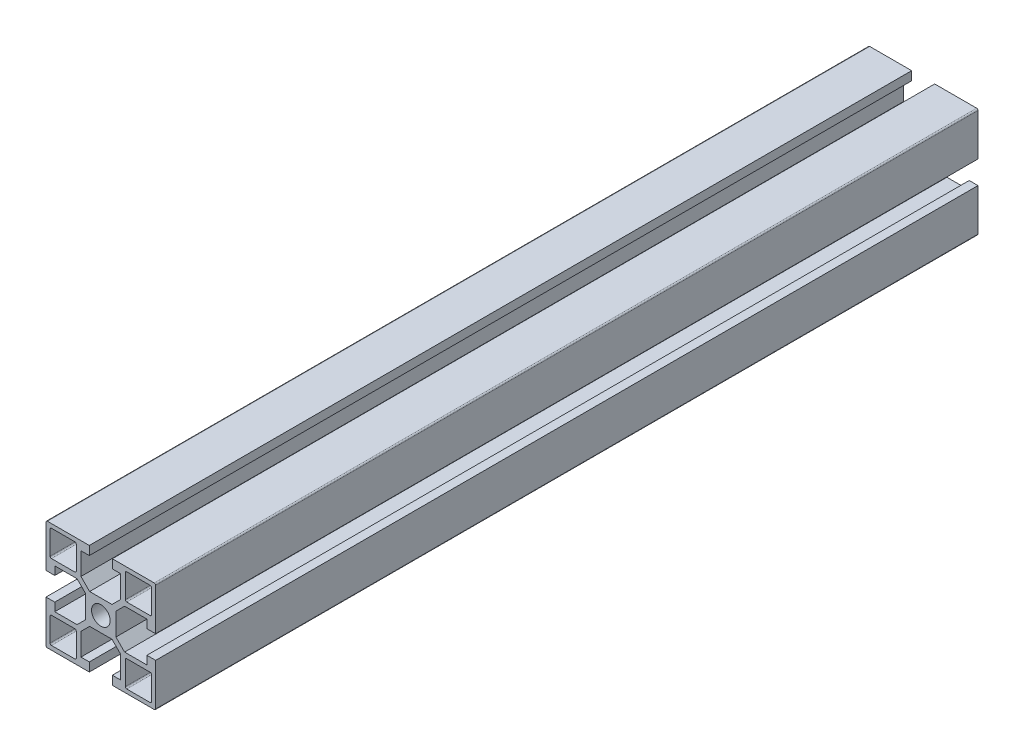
ISO-10303-21;
HEADER;
FILE_DESCRIPTION(('STEP AP214'),'2;1');
FILE_NAME('part.step','',(''),(''),'','','');
FILE_SCHEMA(('AUTOMOTIVE_DESIGN { 1 0 10303 214 1 1 1 1 }'));
ENDSEC;
DATA;
#1=APPLICATION_CONTEXT('core data for automotive mechanical design processes');
#2=APPLICATION_PROTOCOL_DEFINITION('international standard','automotive_design',2000,#1);
#3=PRODUCT_CONTEXT('',#1,'mechanical');
#4=PRODUCT('Part','Part','',(#3));
#5=PRODUCT_RELATED_PRODUCT_CATEGORY('part','',(#4));
#6=PRODUCT_DEFINITION_FORMATION('','',#4);
#7=PRODUCT_DEFINITION_CONTEXT('part definition',#1,'design');
#8=PRODUCT_DEFINITION('design','',#6,#7);
#9=PRODUCT_DEFINITION_SHAPE('','',#8);
#10=(LENGTH_UNIT() NAMED_UNIT(*) SI_UNIT(.MILLI.,.METRE.));
#11=(NAMED_UNIT(*) PLANE_ANGLE_UNIT() SI_UNIT($,.RADIAN.));
#12=(NAMED_UNIT(*) SI_UNIT($,.STERADIAN.) SOLID_ANGLE_UNIT());
#13=UNCERTAINTY_MEASURE_WITH_UNIT(LENGTH_MEASURE(1.E-05),#10,'distance_accuracy_value','');
#14=(GEOMETRIC_REPRESENTATION_CONTEXT(3) GLOBAL_UNCERTAINTY_ASSIGNED_CONTEXT((#13)) GLOBAL_UNIT_ASSIGNED_CONTEXT((#10,
#11,#12)) REPRESENTATION_CONTEXT('',''));
#15=CARTESIAN_POINT('',(0.,0.,0.));
#16=DIRECTION('',(0.,0.,1.));
#17=DIRECTION('',(1.,0.,0.));
#18=AXIS2_PLACEMENT_3D('',#15,#16,#17);
#19=CARTESIAN_POINT('',(19.4999999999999,19.5000000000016,150.));
#20=DIRECTION('',(0.,0.,1.));
#21=DIRECTION('',(1.,0.,0.));
#22=AXIS2_PLACEMENT_3D('',#19,#20,#21);
#23=PLANE('',#22);
#24=DIRECTION('',(0.,1.,0.));
#25=VECTOR('',#24,1.);
#26=CARTESIAN_POINT('',(18.5269198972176,9.45062161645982,150.));
#27=LINE('',#26,#25);
#28=CARTESIAN_POINT('',(18.5269198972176,9.45062161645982,150.));
#29=VERTEX_POINT('',#28);
#30=CARTESIAN_POINT('',(18.5269198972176,18.0000000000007,150.));
#31=VERTEX_POINT('',#30);
#32=EDGE_CURVE('E542',#29,#31,#27,.T.);
#33=ORIENTED_EDGE('',*,*,#32,.F.);
#34=CARTESIAN_POINT('',(18.0269198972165,9.45062161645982,150.));
#35=DIRECTION('',(0.,0.,1.));
#36=DIRECTION('',(1.,0.,0.));
#37=AXIS2_PLACEMENT_3D('',#34,#35,#36);
#38=CIRCLE('',#37,0.500000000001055);
#39=CARTESIAN_POINT('',(18.0269198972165,8.95062161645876,150.));
#40=VERTEX_POINT('',#39);
#41=EDGE_CURVE('E534',#40,#29,#38,.T.);
#42=ORIENTED_EDGE('',*,*,#41,.F.);
#43=DIRECTION('',(1.,0.,0.));
#44=VECTOR('',#43,1.);
#45=CARTESIAN_POINT('',(9.45408698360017,8.95062161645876,150.));
#46=LINE('',#45,#44);
#47=CARTESIAN_POINT('',(9.45408698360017,8.95062161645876,150.));
#48=VERTEX_POINT('',#47);
#49=EDGE_CURVE('E569',#48,#40,#46,.T.);
#50=ORIENTED_EDGE('',*,*,#49,.F.);
#51=CARTESIAN_POINT('',(9.45408698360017,9.45062161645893,150.));
#52=DIRECTION('',(0.,0.,1.));
#53=DIRECTION('',(1.,0.,0.));
#54=AXIS2_PLACEMENT_3D('',#51,#52,#53);
#55=CIRCLE('',#54,0.500000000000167);
#56=CARTESIAN_POINT('',(8.95408698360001,9.45062161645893,150.));
#57=VERTEX_POINT('',#56);
#58=EDGE_CURVE('E567',#57,#48,#55,.T.);
#59=ORIENTED_EDGE('',*,*,#58,.F.);
#60=DIRECTION('',(0.,-1.,0.));
#61=VECTOR('',#60,1.);
#62=CARTESIAN_POINT('',(8.95408698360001,18.0000000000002,150.));
#63=LINE('',#62,#61);
#64=CARTESIAN_POINT('',(8.95408698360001,18.0000000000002,150.));
#65=VERTEX_POINT('',#64);
#66=EDGE_CURVE('E565',#65,#57,#63,.T.);
#67=ORIENTED_EDGE('',*,*,#66,.F.);
#68=CARTESIAN_POINT('',(9.45408698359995,18.0000000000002,150.));
#69=DIRECTION('',(0.,0.,1.));
#70=DIRECTION('',(1.,0.,0.));
#71=AXIS2_PLACEMENT_3D('',#68,#69,#70);
#72=CIRCLE('',#71,0.499999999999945);
#73=CARTESIAN_POINT('',(9.45408698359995,18.5000000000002,150.));
#74=VERTEX_POINT('',#73);
#75=EDGE_CURVE('E563',#74,#65,#72,.T.);
#76=ORIENTED_EDGE('',*,*,#75,.F.);
#77=DIRECTION('',(-1.,0.,0.));
#78=VECTOR('',#77,1.);
#79=CARTESIAN_POINT('',(18.0269198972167,18.5000000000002,150.));
#80=LINE('',#79,#78);
#81=CARTESIAN_POINT('',(18.0269198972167,18.5000000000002,150.));
#82=VERTEX_POINT('',#81);
#83=EDGE_CURVE('E558',#82,#74,#80,.T.);
#84=ORIENTED_EDGE('',*,*,#83,.F.);
#85=CARTESIAN_POINT('',(18.0269198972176,18.0000000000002,150.));
#86=DIRECTION('',(0.,0.,1.));
#87=DIRECTION('',(1.,0.,0.));
#88=AXIS2_PLACEMENT_3D('',#85,#86,#87);
#89=CIRCLE('',#88,0.499999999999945);
#90=EDGE_CURVE('E556',#31,#82,#89,.T.);
#91=ORIENTED_EDGE('',*,*,#90,.F.);
#92=EDGE_LOOP('',(#33,#42,#50,#59,#67,#76,#84,#91));
#93=FACE_BOUND('',#92,.T.);
#94=DIRECTION('',(0.,-1.,0.));
#95=VECTOR('',#94,1.);
#96=CARTESIAN_POINT('',(-18.526919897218,-9.45062161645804,150.));
#97=LINE('',#96,#95);
#98=CARTESIAN_POINT('',(-18.526919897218,-9.45062161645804,150.));
#99=VERTEX_POINT('',#98);
#100=CARTESIAN_POINT('',(-18.526919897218,-17.9999999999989,150.));
#101=VERTEX_POINT('',#100);
#102=EDGE_CURVE('E663',#99,#101,#97,.T.);
#103=ORIENTED_EDGE('',*,*,#102,.F.);
#104=CARTESIAN_POINT('',(-18.0269198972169,-9.45062161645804,150.));
#105=DIRECTION('',(0.,0.,1.));
#106=DIRECTION('',(1.,0.,0.));
#107=AXIS2_PLACEMENT_3D('',#104,#105,#106);
#108=CIRCLE('',#107,0.500000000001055);
#109=CARTESIAN_POINT('',(-18.0269198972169,-8.95062161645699,150.));
#110=VERTEX_POINT('',#109);
#111=EDGE_CURVE('E661',#110,#99,#108,.T.);
#112=ORIENTED_EDGE('',*,*,#111,.F.);
#113=DIRECTION('',(-1.,0.,0.));
#114=VECTOR('',#113,1.);
#115=CARTESIAN_POINT('',(-9.45408698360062,-8.95062161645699,150.));
#116=LINE('',#115,#114);
#117=CARTESIAN_POINT('',(-9.45408698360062,-8.95062161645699,150.));
#118=VERTEX_POINT('',#117);
#119=EDGE_CURVE('E677',#118,#110,#116,.T.);
#120=ORIENTED_EDGE('',*,*,#119,.F.);
#121=CARTESIAN_POINT('',(-9.45408698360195,-9.45062161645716,150.));
#122=DIRECTION('',(0.,0.,1.));
#123=DIRECTION('',(1.,0.,0.));
#124=AXIS2_PLACEMENT_3D('',#121,#122,#123);
#125=CIRCLE('',#124,0.500000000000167);
#126=CARTESIAN_POINT('',(-8.95408698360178,-9.45062161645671,150.));
#127=VERTEX_POINT('',#126);
#128=EDGE_CURVE('E674',#127,#118,#125,.T.);
#129=ORIENTED_EDGE('',*,*,#128,.F.);
#130=DIRECTION('',(0.,1.,0.));
#131=VECTOR('',#130,1.);
#132=CARTESIAN_POINT('',(-8.95408698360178,-17.999999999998,150.));
#133=LINE('',#132,#131);
#134=CARTESIAN_POINT('',(-8.95408698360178,-17.999999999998,150.));
#135=VERTEX_POINT('',#134);
#136=EDGE_CURVE('E672',#135,#127,#133,.T.);
#137=ORIENTED_EDGE('',*,*,#136,.F.);
#138=CARTESIAN_POINT('',(-9.45408698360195,-17.999999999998,150.));
#139=DIRECTION('',(0.,0.,1.));
#140=DIRECTION('',(1.,0.,0.));
#141=AXIS2_PLACEMENT_3D('',#138,#139,#140);
#142=CIRCLE('',#141,0.500000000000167);
#143=CARTESIAN_POINT('',(-9.45408698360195,-18.4999999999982,150.));
#144=VERTEX_POINT('',#143);
#145=EDGE_CURVE('E670',#144,#135,#142,.T.);
#146=ORIENTED_EDGE('',*,*,#145,.F.);
#147=DIRECTION('',(1.,0.,0.));
#148=VECTOR('',#147,1.);
#149=CARTESIAN_POINT('',(-18.0269198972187,-18.4999999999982,150.));
#150=LINE('',#149,#148);
#151=CARTESIAN_POINT('',(-18.0269198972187,-18.4999999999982,150.));
#152=VERTEX_POINT('',#151);
#153=EDGE_CURVE('E668',#152,#144,#150,.T.);
#154=ORIENTED_EDGE('',*,*,#153,.F.);
#155=CARTESIAN_POINT('',(-18.0269198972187,-17.9999999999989,150.));
#156=DIRECTION('',(0.,0.,1.));
#157=DIRECTION('',(1.,0.,0.));
#158=AXIS2_PLACEMENT_3D('',#155,#156,#157);
#159=CIRCLE('',#158,0.499999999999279);
#160=EDGE_CURVE('E666',#101,#152,#159,.T.);
#161=ORIENTED_EDGE('',*,*,#160,.F.);
#162=EDGE_LOOP('',(#103,#112,#120,#129,#137,#146,#154,#161));
#163=FACE_BOUND('',#162,.T.);
#164=DIRECTION('',(0.,1.,0.));
#165=VECTOR('',#164,1.);
#166=CARTESIAN_POINT('',(19.9999999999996,-19.4999999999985,150.));
#167=LINE('',#166,#165);
#168=CARTESIAN_POINT('',(19.9999999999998,-19.4999999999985,150.));
#169=VERTEX_POINT('',#168);
#170=CARTESIAN_POINT('',(19.9999999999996,-4.19999999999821,150.));
#171=VERTEX_POINT('',#170);
#172=EDGE_CURVE('E779',#169,#171,#167,.T.);
#173=ORIENTED_EDGE('',*,*,#172,.T.);
#174=DIRECTION('',(-1.,0.,0.));
#175=VECTOR('',#174,1.);
#176=CARTESIAN_POINT('',(19.9999999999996,-4.19999999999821,150.));
#177=LINE('',#176,#175);
#178=CARTESIAN_POINT('',(16.7999999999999,-4.19999999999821,150.));
#179=VERTEX_POINT('',#178);
#180=EDGE_CURVE('E782',#171,#179,#177,.T.);
#181=ORIENTED_EDGE('',*,*,#180,.T.);
#182=DIRECTION('',(0.,-1.,0.));
#183=VECTOR('',#182,1.);
#184=CARTESIAN_POINT('',(16.7999999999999,-4.19999999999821,150.));
#185=LINE('',#184,#183);
#186=CARTESIAN_POINT('',(16.7999999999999,-7.24999999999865,150.));
#187=VERTEX_POINT('',#186);
#188=EDGE_CURVE('E785',#179,#187,#185,.T.);
#189=ORIENTED_EDGE('',*,*,#188,.T.);
#190=DIRECTION('',(-1.,0.,0.));
#191=VECTOR('',#190,1.);
#192=CARTESIAN_POINT('',(16.7999999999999,-7.24999999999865,150.));
#193=LINE('',#192,#191);
#194=CARTESIAN_POINT('',(8.66421356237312,-7.24999999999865,150.));
#195=VERTEX_POINT('',#194);
#196=EDGE_CURVE('E787',#187,#195,#193,.T.);
#197=ORIENTED_EDGE('',*,*,#196,.T.);
#198=DIRECTION('',(-0.707106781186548,0.707106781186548,0.));
#199=VECTOR('',#198,1.);
#200=CARTESIAN_POINT('',(8.66421356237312,-7.24999999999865,150.));
#201=LINE('',#200,#199);
#202=CARTESIAN_POINT('',(5.49999999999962,-4.08578643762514,150.));
#203=VERTEX_POINT('',#202);
#204=EDGE_CURVE('E789',#195,#203,#201,.T.);
#205=ORIENTED_EDGE('',*,*,#204,.T.);
#206=DIRECTION('',(0.,1.,0.));
#207=VECTOR('',#206,1.);
#208=CARTESIAN_POINT('',(5.49999999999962,-4.08578643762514,150.));
#209=LINE('',#208,#207);
#210=CARTESIAN_POINT('',(5.49999999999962,4.08578643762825,150.));
#211=VERTEX_POINT('',#210);
#212=EDGE_CURVE('E791',#203,#211,#209,.T.);
#213=ORIENTED_EDGE('',*,*,#212,.T.);
#214=DIRECTION('',(0.707106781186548,0.707106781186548,0.));
#215=VECTOR('',#214,1.);
#216=CARTESIAN_POINT('',(5.49999999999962,4.08578643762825,150.));
#217=LINE('',#216,#215);
#218=CARTESIAN_POINT('',(8.66421356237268,7.25000000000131,150.));
#219=VERTEX_POINT('',#218);
#220=EDGE_CURVE('E793',#211,#219,#217,.T.);
#221=ORIENTED_EDGE('',*,*,#220,.T.);
#222=DIRECTION('',(1.,0.,0.));
#223=VECTOR('',#222,1.);
#224=CARTESIAN_POINT('',(8.66421356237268,7.25000000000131,150.));
#225=LINE('',#224,#223);
#226=CARTESIAN_POINT('',(16.7999999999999,7.25000000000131,150.));
#227=VERTEX_POINT('',#226);
#228=EDGE_CURVE('E795',#219,#227,#225,.T.);
#229=ORIENTED_EDGE('',*,*,#228,.T.);
#230=DIRECTION('',(0.,-1.,0.));
#231=VECTOR('',#230,1.);
#232=CARTESIAN_POINT('',(16.7999999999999,7.25000000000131,150.));
#233=LINE('',#232,#231);
#234=CARTESIAN_POINT('',(16.7999999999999,4.20000000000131,150.));
#235=VERTEX_POINT('',#234);
#236=EDGE_CURVE('E797',#227,#235,#233,.T.);
#237=ORIENTED_EDGE('',*,*,#236,.T.);
#238=DIRECTION('',(1.,0.,0.));
#239=VECTOR('',#238,1.);
#240=CARTESIAN_POINT('',(16.7999999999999,4.20000000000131,150.));
#241=LINE('',#240,#239);
#242=CARTESIAN_POINT('',(19.9999999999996,4.20000000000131,150.));
#243=VERTEX_POINT('',#242);
#244=EDGE_CURVE('E799',#235,#243,#241,.T.);
#245=ORIENTED_EDGE('',*,*,#244,.T.);
#246=DIRECTION('',(0.,1.,0.));
#247=VECTOR('',#246,1.);
#248=CARTESIAN_POINT('',(19.9999999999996,4.20000000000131,150.));
#249=LINE('',#248,#247);
#250=CARTESIAN_POINT('',(19.9999999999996,19.5000000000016,150.));
#251=VERTEX_POINT('',#250);
#252=EDGE_CURVE('E801',#243,#251,#249,.T.);
#253=ORIENTED_EDGE('',*,*,#252,.T.);
#254=CARTESIAN_POINT('',(19.4999999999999,19.5000000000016,150.));
#255=DIRECTION('',(0.,0.,1.));
#256=DIRECTION('',(1.,0.,0.));
#257=AXIS2_PLACEMENT_3D('',#254,#255,#256);
#258=CIRCLE('',#257,0.499999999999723);
#259=CARTESIAN_POINT('',(19.4999999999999,20.0000000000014,150.));
#260=VERTEX_POINT('',#259);
#261=EDGE_CURVE('E803',#251,#260,#258,.T.);
#262=ORIENTED_EDGE('',*,*,#261,.T.);
#263=DIRECTION('',(-1.,0.,0.));
#264=VECTOR('',#263,1.);
#265=CARTESIAN_POINT('',(19.4999999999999,20.0000000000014,150.));
#266=LINE('',#265,#264);
#267=CARTESIAN_POINT('',(4.19999999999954,20.0000000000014,150.));
#268=VERTEX_POINT('',#267);
#269=EDGE_CURVE('E805',#260,#268,#266,.T.);
#270=ORIENTED_EDGE('',*,*,#269,.T.);
#271=DIRECTION('',(0.,-1.,0.));
#272=VECTOR('',#271,1.);
#273=CARTESIAN_POINT('',(4.19999999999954,20.0000000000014,150.));
#274=LINE('',#273,#272);
#275=CARTESIAN_POINT('',(4.19999999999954,16.8000000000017,150.));
#276=VERTEX_POINT('',#275);
#277=EDGE_CURVE('E807',#268,#276,#274,.T.);
#278=ORIENTED_EDGE('',*,*,#277,.T.);
#279=DIRECTION('',(1.,0.,0.));
#280=VECTOR('',#279,1.);
#281=CARTESIAN_POINT('',(4.19999999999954,16.8000000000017,150.));
#282=LINE('',#281,#280);
#283=CARTESIAN_POINT('',(7.24999999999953,16.8000000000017,150.));
#284=VERTEX_POINT('',#283);
#285=EDGE_CURVE('E809',#276,#284,#282,.T.);
#286=ORIENTED_EDGE('',*,*,#285,.T.);
#287=DIRECTION('',(0.,-1.,0.));
#288=VECTOR('',#287,1.);
#289=CARTESIAN_POINT('',(7.24999999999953,16.8000000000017,150.));
#290=LINE('',#289,#288);
#291=CARTESIAN_POINT('',(7.24999999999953,8.66421356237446,150.));
#292=VERTEX_POINT('',#291);
#293=EDGE_CURVE('E811',#284,#292,#290,.T.);
#294=ORIENTED_EDGE('',*,*,#293,.T.);
#295=DIRECTION('',(-0.707106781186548,-0.707106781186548,0.));
#296=VECTOR('',#295,1.);
#297=CARTESIAN_POINT('',(7.24999999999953,8.66421356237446,150.));
#298=LINE('',#297,#296);
#299=CARTESIAN_POINT('',(4.08578643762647,5.50000000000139,150.));
#300=VERTEX_POINT('',#299);
#301=EDGE_CURVE('E813',#292,#300,#298,.T.);
#302=ORIENTED_EDGE('',*,*,#301,.T.);
#303=DIRECTION('',(-1.,0.,0.));
#304=VECTOR('',#303,1.);
#305=CARTESIAN_POINT('',(4.08578643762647,5.50000000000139,150.));
#306=LINE('',#305,#304);
#307=CARTESIAN_POINT('',(-4.08578643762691,5.50000000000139,150.));
#308=VERTEX_POINT('',#307);
#309=EDGE_CURVE('E815',#300,#308,#306,.T.);
#310=ORIENTED_EDGE('',*,*,#309,.T.);
#311=DIRECTION('',(-0.707106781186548,0.707106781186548,0.));
#312=VECTOR('',#311,1.);
#313=CARTESIAN_POINT('',(-4.08578643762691,5.50000000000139,150.));
#314=LINE('',#313,#312);
#315=CARTESIAN_POINT('',(-7.25000000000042,8.6642135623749,150.));
#316=VERTEX_POINT('',#315);
#317=EDGE_CURVE('E817',#308,#316,#314,.T.);
#318=ORIENTED_EDGE('',*,*,#317,.T.);
#319=DIRECTION('',(0.,1.,0.));
#320=VECTOR('',#319,1.);
#321=CARTESIAN_POINT('',(-7.25000000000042,8.6642135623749,150.));
#322=LINE('',#321,#320);
#323=CARTESIAN_POINT('',(-7.25000000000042,16.8000000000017,150.));
#324=VERTEX_POINT('',#323);
#325=EDGE_CURVE('E819',#316,#324,#322,.T.);
#326=ORIENTED_EDGE('',*,*,#325,.T.);
#327=DIRECTION('',(1.,0.,0.));
#328=VECTOR('',#327,1.);
#329=CARTESIAN_POINT('',(-7.25000000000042,16.8000000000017,150.));
#330=LINE('',#329,#328);
#331=CARTESIAN_POINT('',(-4.19999999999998,16.8000000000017,150.));
#332=VERTEX_POINT('',#331);
#333=EDGE_CURVE('E821',#324,#332,#330,.T.);
#334=ORIENTED_EDGE('',*,*,#333,.T.);
#335=DIRECTION('',(0.,1.,0.));
#336=VECTOR('',#335,1.);
#337=CARTESIAN_POINT('',(-4.19999999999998,16.8000000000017,150.));
#338=LINE('',#337,#336);
#339=CARTESIAN_POINT('',(-4.19999999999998,20.0000000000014,150.));
#340=VERTEX_POINT('',#339);
#341=EDGE_CURVE('E823',#332,#340,#338,.T.);
#342=ORIENTED_EDGE('',*,*,#341,.T.);
#343=DIRECTION('',(-1.,0.,0.));
#344=VECTOR('',#343,1.);
#345=CARTESIAN_POINT('',(-4.19999999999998,20.0000000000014,150.));
#346=LINE('',#345,#344);
#347=CARTESIAN_POINT('',(-19.5000000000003,20.0000000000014,150.));
#348=VERTEX_POINT('',#347);
#349=EDGE_CURVE('E825',#340,#348,#346,.T.);
#350=ORIENTED_EDGE('',*,*,#349,.T.);
#351=CARTESIAN_POINT('',(-19.5000000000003,19.5000000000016,150.));
#352=DIRECTION('',(0.,0.,1.));
#353=DIRECTION('',(1.,0.,0.));
#354=AXIS2_PLACEMENT_3D('',#351,#352,#353);
#355=CIRCLE('',#354,0.499999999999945);
#356=CARTESIAN_POINT('',(-20.0000000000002,19.5000000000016,150.));
#357=VERTEX_POINT('',#356);
#358=EDGE_CURVE('E827',#348,#357,#355,.T.);
#359=ORIENTED_EDGE('',*,*,#358,.T.);
#360=DIRECTION('',(0.,-1.,0.));
#361=VECTOR('',#360,1.);
#362=CARTESIAN_POINT('',(-20.0000000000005,19.5000000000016,150.));
#363=LINE('',#362,#361);
#364=CARTESIAN_POINT('',(-20.0000000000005,4.20000000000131,150.));
#365=VERTEX_POINT('',#364);
#366=EDGE_CURVE('E829',#357,#365,#363,.T.);
#367=ORIENTED_EDGE('',*,*,#366,.T.);
#368=DIRECTION('',(1.,0.,0.));
#369=VECTOR('',#368,1.);
#370=CARTESIAN_POINT('',(-20.0000000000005,4.20000000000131,150.));
#371=LINE('',#370,#369);
#372=CARTESIAN_POINT('',(-16.8000000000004,4.20000000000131,150.));
#373=VERTEX_POINT('',#372);
#374=EDGE_CURVE('E831',#365,#373,#371,.T.);
#375=ORIENTED_EDGE('',*,*,#374,.T.);
#376=DIRECTION('',(0.,1.,0.));
#377=VECTOR('',#376,1.);
#378=CARTESIAN_POINT('',(-16.8000000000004,4.20000000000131,150.));
#379=LINE('',#378,#377);
#380=CARTESIAN_POINT('',(-16.8000000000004,7.25000000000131,150.));
#381=VERTEX_POINT('',#380);
#382=EDGE_CURVE('E833',#373,#381,#379,.T.);
#383=ORIENTED_EDGE('',*,*,#382,.T.);
#384=DIRECTION('',(1.,0.,0.));
#385=VECTOR('',#384,1.);
#386=CARTESIAN_POINT('',(-16.8000000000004,7.25000000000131,150.));
#387=LINE('',#386,#385);
#388=CARTESIAN_POINT('',(-8.66421356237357,7.25000000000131,150.));
#389=VERTEX_POINT('',#388);
#390=EDGE_CURVE('E835',#381,#389,#387,.T.);
#391=ORIENTED_EDGE('',*,*,#390,.T.);
#392=DIRECTION('',(0.707106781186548,-0.707106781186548,0.));
#393=VECTOR('',#392,1.);
#394=CARTESIAN_POINT('',(-8.66421356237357,7.25000000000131,150.));
#395=LINE('',#394,#393);
#396=CARTESIAN_POINT('',(-5.5000000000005,4.08578643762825,150.));
#397=VERTEX_POINT('',#396);
#398=EDGE_CURVE('E837',#389,#397,#395,.T.);
#399=ORIENTED_EDGE('',*,*,#398,.T.);
#400=DIRECTION('',(0.,-1.,0.));
#401=VECTOR('',#400,1.);
#402=CARTESIAN_POINT('',(-5.5000000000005,4.08578643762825,150.));
#403=LINE('',#402,#401);
#404=CARTESIAN_POINT('',(-5.5000000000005,-4.08578643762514,150.));
#405=VERTEX_POINT('',#404);
#406=EDGE_CURVE('E839',#397,#405,#403,.T.);
#407=ORIENTED_EDGE('',*,*,#406,.T.);
#408=DIRECTION('',(-0.707106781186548,-0.707106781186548,0.));
#409=VECTOR('',#408,1.);
#410=CARTESIAN_POINT('',(-5.5000000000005,-4.08578643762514,150.));
#411=LINE('',#410,#409);
#412=CARTESIAN_POINT('',(-8.66421356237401,-7.24999999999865,150.));
#413=VERTEX_POINT('',#412);
#414=EDGE_CURVE('E841',#405,#413,#411,.T.);
#415=ORIENTED_EDGE('',*,*,#414,.T.);
#416=DIRECTION('',(-1.,0.,0.));
#417=VECTOR('',#416,1.);
#418=CARTESIAN_POINT('',(-8.66421356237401,-7.24999999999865,150.));
#419=LINE('',#418,#417);
#420=CARTESIAN_POINT('',(-16.8000000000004,-7.24999999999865,150.));
#421=VERTEX_POINT('',#420);
#422=EDGE_CURVE('E843',#413,#421,#419,.T.);
#423=ORIENTED_EDGE('',*,*,#422,.T.);
#424=DIRECTION('',(0.,1.,0.));
#425=VECTOR('',#424,1.);
#426=CARTESIAN_POINT('',(-16.8000000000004,-7.24999999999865,150.));
#427=LINE('',#426,#425);
#428=CARTESIAN_POINT('',(-16.8000000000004,-4.19999999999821,150.));
#429=VERTEX_POINT('',#428);
#430=EDGE_CURVE('E845',#421,#429,#427,.T.);
#431=ORIENTED_EDGE('',*,*,#430,.T.);
#432=DIRECTION('',(-1.,0.,0.));
#433=VECTOR('',#432,1.);
#434=CARTESIAN_POINT('',(-16.8000000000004,-4.19999999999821,150.));
#435=LINE('',#434,#433);
#436=CARTESIAN_POINT('',(-20.0000000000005,-4.19999999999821,150.));
#437=VERTEX_POINT('',#436);
#438=EDGE_CURVE('E847',#429,#437,#435,.T.);
#439=ORIENTED_EDGE('',*,*,#438,.T.);
#440=DIRECTION('',(0.,-1.,0.));
#441=VECTOR('',#440,1.);
#442=CARTESIAN_POINT('',(-20.0000000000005,-4.19999999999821,150.));
#443=LINE('',#442,#441);
#444=CARTESIAN_POINT('',(-20.0000000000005,-19.4999999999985,150.));
#445=VERTEX_POINT('',#444);
#446=EDGE_CURVE('E849',#437,#445,#443,.T.);
#447=ORIENTED_EDGE('',*,*,#446,.T.);
#448=CARTESIAN_POINT('',(-19.5000000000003,-19.4999999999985,150.));
#449=DIRECTION('',(0.,0.,1.));
#450=DIRECTION('',(1.,0.,0.));
#451=AXIS2_PLACEMENT_3D('',#448,#449,#450);
#452=CIRCLE('',#451,0.500000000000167);
#453=CARTESIAN_POINT('',(-19.5000000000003,-19.9999999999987,150.));
#454=VERTEX_POINT('',#453);
#455=EDGE_CURVE('E851',#445,#454,#452,.T.);
#456=ORIENTED_EDGE('',*,*,#455,.T.);
#457=DIRECTION('',(1.,0.,0.));
#458=VECTOR('',#457,1.);
#459=CARTESIAN_POINT('',(-19.5000000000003,-19.9999999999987,150.));
#460=LINE('',#459,#458);
#461=CARTESIAN_POINT('',(-4.19999999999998,-19.9999999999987,150.));
#462=VERTEX_POINT('',#461);
#463=EDGE_CURVE('E853',#454,#462,#460,.T.);
#464=ORIENTED_EDGE('',*,*,#463,.T.);
#465=DIRECTION('',(0.,1.,0.));
#466=VECTOR('',#465,1.);
#467=CARTESIAN_POINT('',(-4.19999999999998,-19.9999999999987,150.));
#468=LINE('',#467,#466);
#469=CARTESIAN_POINT('',(-4.19999999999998,-16.7999999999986,150.));
#470=VERTEX_POINT('',#469);
#471=EDGE_CURVE('E855',#462,#470,#468,.T.);
#472=ORIENTED_EDGE('',*,*,#471,.T.);
#473=DIRECTION('',(-1.,0.,0.));
#474=VECTOR('',#473,1.);
#475=CARTESIAN_POINT('',(-4.19999999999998,-16.7999999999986,150.));
#476=LINE('',#475,#474);
#477=CARTESIAN_POINT('',(-7.25000000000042,-16.7999999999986,150.));
#478=VERTEX_POINT('',#477);
#479=EDGE_CURVE('E857',#470,#478,#476,.T.);
#480=ORIENTED_EDGE('',*,*,#479,.T.);
#481=DIRECTION('',(0.,1.,0.));
#482=VECTOR('',#481,1.);
#483=CARTESIAN_POINT('',(-7.25000000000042,-16.7999999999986,150.));
#484=LINE('',#483,#482);
#485=CARTESIAN_POINT('',(-7.25000000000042,-8.66421356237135,150.));
#486=VERTEX_POINT('',#485);
#487=EDGE_CURVE('E859',#478,#486,#484,.T.);
#488=ORIENTED_EDGE('',*,*,#487,.T.);
#489=DIRECTION('',(0.707106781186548,0.707106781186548,0.));
#490=VECTOR('',#489,1.);
#491=CARTESIAN_POINT('',(-7.25000000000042,-8.66421356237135,150.));
#492=LINE('',#491,#490);
#493=CARTESIAN_POINT('',(-4.08578643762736,-5.49999999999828,150.));
#494=VERTEX_POINT('',#493);
#495=EDGE_CURVE('E861',#486,#494,#492,.T.);
#496=ORIENTED_EDGE('',*,*,#495,.T.);
#497=DIRECTION('',(1.,0.,0.));
#498=VECTOR('',#497,1.);
#499=CARTESIAN_POINT('',(-4.08578643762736,-5.49999999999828,150.));
#500=LINE('',#499,#498);
#501=CARTESIAN_POINT('',(4.08578643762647,-5.49999999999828,150.));
#502=VERTEX_POINT('',#501);
#503=EDGE_CURVE('E863',#494,#502,#500,.T.);
#504=ORIENTED_EDGE('',*,*,#503,.T.);
#505=DIRECTION('',(0.707106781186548,-0.707106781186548,0.));
#506=VECTOR('',#505,1.);
#507=CARTESIAN_POINT('',(4.08578643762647,-5.49999999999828,150.));
#508=LINE('',#507,#506);
#509=CARTESIAN_POINT('',(7.24999999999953,-8.66421356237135,150.));
#510=VERTEX_POINT('',#509);
#511=EDGE_CURVE('E865',#502,#510,#508,.T.);
#512=ORIENTED_EDGE('',*,*,#511,.T.);
#513=DIRECTION('',(0.,-1.,0.));
#514=VECTOR('',#513,1.);
#515=CARTESIAN_POINT('',(7.24999999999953,-8.66421356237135,150.));
#516=LINE('',#515,#514);
#517=CARTESIAN_POINT('',(7.24999999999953,-16.7999999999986,150.));
#518=VERTEX_POINT('',#517);
#519=EDGE_CURVE('E867',#510,#518,#516,.T.);
#520=ORIENTED_EDGE('',*,*,#519,.T.);
#521=DIRECTION('',(-1.,0.,0.));
#522=VECTOR('',#521,1.);
#523=CARTESIAN_POINT('',(7.24999999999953,-16.7999999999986,150.));
#524=LINE('',#523,#522);
#525=CARTESIAN_POINT('',(4.19999999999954,-16.7999999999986,150.));
#526=VERTEX_POINT('',#525);
#527=EDGE_CURVE('E869',#518,#526,#524,.T.);
#528=ORIENTED_EDGE('',*,*,#527,.T.);
#529=DIRECTION('',(0.,-1.,0.));
#530=VECTOR('',#529,1.);
#531=CARTESIAN_POINT('',(4.19999999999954,-16.7999999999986,150.));
#532=LINE('',#531,#530);
#533=CARTESIAN_POINT('',(4.19999999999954,-19.9999999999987,150.));
#534=VERTEX_POINT('',#533);
#535=EDGE_CURVE('E871',#526,#534,#532,.T.);
#536=ORIENTED_EDGE('',*,*,#535,.T.);
#537=DIRECTION('',(1.,0.,0.));
#538=VECTOR('',#537,1.);
#539=CARTESIAN_POINT('',(4.19999999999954,-19.9999999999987,150.));
#540=LINE('',#539,#538);
#541=CARTESIAN_POINT('',(19.4999999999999,-19.9999999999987,150.));
#542=VERTEX_POINT('',#541);
#543=EDGE_CURVE('E873',#534,#542,#540,.T.);
#544=ORIENTED_EDGE('',*,*,#543,.T.);
#545=CARTESIAN_POINT('',(19.4999999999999,-19.4999999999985,150.));
#546=DIRECTION('',(0.,0.,1.));
#547=DIRECTION('',(1.,0.,0.));
#548=AXIS2_PLACEMENT_3D('',#545,#546,#547);
#549=CIRCLE('',#548,0.499999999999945);
#550=EDGE_CURVE('E875',#542,#169,#549,.T.);
#551=ORIENTED_EDGE('',*,*,#550,.T.);
#552=EDGE_LOOP('',(#173,#181,#189,#197,#205,#213,#221,#229,#237,#245,#253,#262,#270,#278,#286,
#294,#302,#310,#318,#326,#334,#342,#350,#359,#367,#375,#383,#391,#399,#407,#415,#423,#431,#439,
#447,#456,#464,#472,#480,#488,#496,#504,#512,#520,#528,#536,#544,#551));
#553=FACE_BOUND('',#552,.T.);
#554=DIRECTION('',(-1.,0.,0.));
#555=VECTOR('',#554,1.);
#556=CARTESIAN_POINT('',(-9.45062161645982,18.5269198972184,150.));
#557=LINE('',#556,#555);
#558=CARTESIAN_POINT('',(-9.45062161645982,18.5269198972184,150.));
#559=VERTEX_POINT('',#558);
#560=CARTESIAN_POINT('',(-18.0000000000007,18.5269198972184,150.));
#561=VERTEX_POINT('',#560);
#562=EDGE_CURVE('E722',#559,#561,#557,.T.);
#563=ORIENTED_EDGE('',*,*,#562,.F.);
#564=CARTESIAN_POINT('',(-9.45062161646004,18.0269198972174,150.));
#565=DIRECTION('',(0.,0.,1.));
#566=DIRECTION('',(1.,0.,0.));
#567=AXIS2_PLACEMENT_3D('',#564,#565,#566);
#568=CIRCLE('',#567,0.500000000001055);
#569=CARTESIAN_POINT('',(-8.95062161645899,18.0269198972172,150.));
#570=VERTEX_POINT('',#569);
#571=EDGE_CURVE('E720',#570,#559,#568,.T.);
#572=ORIENTED_EDGE('',*,*,#571,.F.);
#573=DIRECTION('',(0.,1.,0.));
#574=VECTOR('',#573,1.);
#575=CARTESIAN_POINT('',(-8.95062161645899,9.45408698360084,150.));
#576=LINE('',#575,#574);
#577=CARTESIAN_POINT('',(-8.95062161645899,9.45408698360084,150.));
#578=VERTEX_POINT('',#577);
#579=EDGE_CURVE('E736',#578,#570,#576,.T.);
#580=ORIENTED_EDGE('',*,*,#579,.F.);
#581=CARTESIAN_POINT('',(-9.45062161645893,9.45408698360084,150.));
#582=DIRECTION('',(0.,0.,1.));
#583=DIRECTION('',(1.,0.,0.));
#584=AXIS2_PLACEMENT_3D('',#581,#582,#583);
#585=CIRCLE('',#584,0.499999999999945);
#586=CARTESIAN_POINT('',(-9.45062161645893,8.9540869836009,150.));
#587=VERTEX_POINT('',#586);
#588=EDGE_CURVE('E733',#587,#578,#585,.T.);
#589=ORIENTED_EDGE('',*,*,#588,.F.);
#590=DIRECTION('',(1.,0.,0.));
#591=VECTOR('',#590,1.);
#592=CARTESIAN_POINT('',(-18.0000000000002,8.9540869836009,150.));
#593=LINE('',#592,#591);
#594=CARTESIAN_POINT('',(-18.0000000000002,8.9540869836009,150.));
#595=VERTEX_POINT('',#594);
#596=EDGE_CURVE('E731',#595,#587,#593,.T.);
#597=ORIENTED_EDGE('',*,*,#596,.F.);
#598=CARTESIAN_POINT('',(-18.0000000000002,9.45408698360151,150.));
#599=DIRECTION('',(0.,0.,1.));
#600=DIRECTION('',(1.,0.,0.));
#601=AXIS2_PLACEMENT_3D('',#598,#599,#600);
#602=CIRCLE('',#601,0.500000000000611);
#603=CARTESIAN_POINT('',(-18.5000000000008,9.45408698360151,150.));
#604=VERTEX_POINT('',#603);
#605=EDGE_CURVE('E729',#604,#595,#602,.T.);
#606=ORIENTED_EDGE('',*,*,#605,.F.);
#607=DIRECTION('',(0.,-1.,0.));
#608=VECTOR('',#607,1.);
#609=CARTESIAN_POINT('',(-18.5000000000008,18.0269198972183,150.));
#610=LINE('',#609,#608);
#611=CARTESIAN_POINT('',(-18.5000000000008,18.0269198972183,150.));
#612=VERTEX_POINT('',#611);
#613=EDGE_CURVE('E727',#612,#604,#610,.T.);
#614=ORIENTED_EDGE('',*,*,#613,.F.);
#615=CARTESIAN_POINT('',(-18.0000000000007,18.0269198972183,150.));
#616=DIRECTION('',(0.,0.,1.));
#617=DIRECTION('',(1.,0.,0.));
#618=AXIS2_PLACEMENT_3D('',#615,#616,#617);
#619=CIRCLE('',#618,0.500000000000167);
#620=EDGE_CURVE('E725',#561,#612,#619,.T.);
#621=ORIENTED_EDGE('',*,*,#620,.F.);
#622=EDGE_LOOP('',(#563,#572,#580,#589,#597,#606,#614,#621));
#623=FACE_BOUND('',#622,.T.);
#624=DIRECTION('',(1.,0.,0.));
#625=VECTOR('',#624,1.);
#626=CARTESIAN_POINT('',(9.45062161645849,-18.526919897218,150.));
#627=LINE('',#626,#625);
#628=CARTESIAN_POINT('',(9.45062161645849,-18.526919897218,150.));
#629=VERTEX_POINT('',#628);
#630=CARTESIAN_POINT('',(17.9999999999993,-18.526919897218,150.));
#631=VERTEX_POINT('',#630);
#632=EDGE_CURVE('E604',#629,#631,#627,.T.);
#633=ORIENTED_EDGE('',*,*,#632,.F.);
#634=CARTESIAN_POINT('',(9.45062161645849,-18.0269198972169,150.));
#635=DIRECTION('',(0.,0.,1.));
#636=DIRECTION('',(1.,0.,0.));
#637=AXIS2_PLACEMENT_3D('',#634,#635,#636);
#638=CIRCLE('',#637,0.500000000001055);
#639=CARTESIAN_POINT('',(8.95062161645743,-18.0269198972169,150.));
#640=VERTEX_POINT('',#639);
#641=EDGE_CURVE('E602',#640,#629,#638,.T.);
#642=ORIENTED_EDGE('',*,*,#641,.F.);
#643=DIRECTION('',(0.,-1.,0.));
#644=VECTOR('',#643,1.);
#645=CARTESIAN_POINT('',(8.95062161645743,-9.45408698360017,150.));
#646=LINE('',#645,#644);
#647=CARTESIAN_POINT('',(8.95062161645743,-9.45408698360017,150.));
#648=VERTEX_POINT('',#647);
#649=EDGE_CURVE('E618',#648,#640,#646,.T.);
#650=ORIENTED_EDGE('',*,*,#649,.F.);
#651=CARTESIAN_POINT('',(9.45062161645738,-9.45408698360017,150.));
#652=DIRECTION('',(0.,0.,1.));
#653=DIRECTION('',(1.,0.,0.));
#654=AXIS2_PLACEMENT_3D('',#651,#652,#653);
#655=CIRCLE('',#654,0.499999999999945);
#656=CARTESIAN_POINT('',(9.45062161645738,-8.95408698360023,150.));
#657=VERTEX_POINT('',#656);
#658=EDGE_CURVE('E615',#657,#648,#655,.T.);
#659=ORIENTED_EDGE('',*,*,#658,.F.);
#660=DIRECTION('',(-1.,0.,0.));
#661=VECTOR('',#660,1.);
#662=CARTESIAN_POINT('',(17.9999999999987,-8.95408698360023,150.));
#663=LINE('',#662,#661);
#664=CARTESIAN_POINT('',(17.9999999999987,-8.95408698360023,150.));
#665=VERTEX_POINT('',#664);
#666=EDGE_CURVE('E613',#665,#657,#663,.T.);
#667=ORIENTED_EDGE('',*,*,#666,.F.);
#668=CARTESIAN_POINT('',(17.9999999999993,-9.45408698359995,150.));
#669=DIRECTION('',(0.,0.,1.));
#670=DIRECTION('',(1.,0.,0.));
#671=AXIS2_PLACEMENT_3D('',#668,#669,#670);
#672=CIRCLE('',#671,0.499999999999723);
#673=CARTESIAN_POINT('',(18.4999999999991,-9.45408698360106,150.));
#674=VERTEX_POINT('',#673);
#675=EDGE_CURVE('E611',#674,#665,#672,.T.);
#676=ORIENTED_EDGE('',*,*,#675,.F.);
#677=DIRECTION('',(0.,1.,0.));
#678=VECTOR('',#677,1.);
#679=CARTESIAN_POINT('',(18.4999999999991,-18.0269198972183,150.));
#680=LINE('',#679,#678);
#681=CARTESIAN_POINT('',(18.4999999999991,-18.0269198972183,150.));
#682=VERTEX_POINT('',#681);
#683=EDGE_CURVE('E609',#682,#674,#680,.T.);
#684=ORIENTED_EDGE('',*,*,#683,.F.);
#685=CARTESIAN_POINT('',(17.9999999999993,-18.0269198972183,150.));
#686=DIRECTION('',(0.,0.,1.));
#687=DIRECTION('',(1.,0.,0.));
#688=AXIS2_PLACEMENT_3D('',#685,#686,#687);
#689=CIRCLE('',#688,0.499999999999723);
#690=EDGE_CURVE('E607',#631,#682,#689,.T.);
#691=ORIENTED_EDGE('',*,*,#690,.F.);
#692=EDGE_LOOP('',(#633,#642,#650,#659,#667,#676,#684,#691));
#693=FACE_BOUND('',#692,.T.);
#694=CARTESIAN_POINT('',(0.,0.,150.));
#695=DIRECTION('',(0.,0.,1.));
#696=DIRECTION('',(1.,0.,0.));
#697=AXIS2_PLACEMENT_3D('',#694,#695,#696);
#698=CIRCLE('',#697,3.39999999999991);
#699=CARTESIAN_POINT('',(3.39999999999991,0.,150.));
#700=VERTEX_POINT('',#699);
#701=EDGE_CURVE('E572',#700,#700,#698,.T.);
#702=ORIENTED_EDGE('',*,*,#701,.F.);
#703=EDGE_LOOP('',(#702));
#704=FACE_BOUND('',#703,.T.);
#705=ADVANCED_FACE('F37',(#93,#163,#553,#623,#693,#704),#23,.T.);
#706=CARTESIAN_POINT('',(19.4999999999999,19.5000000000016,-150.));
#707=DIRECTION('',(0.,0.,1.));
#708=DIRECTION('',(1.,0.,0.));
#709=AXIS2_PLACEMENT_3D('',#706,#707,#708);
#710=PLANE('',#709);
#711=CARTESIAN_POINT('',(18.0269198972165,9.45062161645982,-150.));
#712=DIRECTION('',(0.,0.,1.));
#713=DIRECTION('',(1.,0.,0.));
#714=AXIS2_PLACEMENT_3D('',#711,#712,#713);
#715=CIRCLE('',#714,0.500000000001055);
#716=CARTESIAN_POINT('',(18.0269198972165,8.95062161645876,-150.));
#717=VERTEX_POINT('',#716);
#718=CARTESIAN_POINT('',(18.5269198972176,9.45062161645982,-150.));
#719=VERTEX_POINT('',#718);
#720=EDGE_CURVE('E60',#717,#719,#715,.T.);
#721=ORIENTED_EDGE('',*,*,#720,.T.);
#722=DIRECTION('',(0.,1.,0.));
#723=VECTOR('',#722,1.);
#724=CARTESIAN_POINT('',(18.5269198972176,9.45062161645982,-150.));
#725=LINE('',#724,#723);
#726=CARTESIAN_POINT('',(18.5269198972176,18.0000000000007,-150.));
#727=VERTEX_POINT('',#726);
#728=EDGE_CURVE('E549',#719,#727,#725,.T.);
#729=ORIENTED_EDGE('',*,*,#728,.T.);
#730=CARTESIAN_POINT('',(18.0269198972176,18.0000000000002,-150.));
#731=DIRECTION('',(0.,0.,1.));
#732=DIRECTION('',(1.,0.,0.));
#733=AXIS2_PLACEMENT_3D('',#730,#731,#732);
#734=CIRCLE('',#733,0.499999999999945);
#735=CARTESIAN_POINT('',(18.0269198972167,18.5000000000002,-150.));
#736=VERTEX_POINT('',#735);
#737=EDGE_CURVE('E574',#727,#736,#734,.T.);
#738=ORIENTED_EDGE('',*,*,#737,.T.);
#739=DIRECTION('',(-1.,0.,0.));
#740=VECTOR('',#739,1.);
#741=CARTESIAN_POINT('',(18.0269198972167,18.5000000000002,-150.));
#742=LINE('',#741,#740);
#743=CARTESIAN_POINT('',(9.45408698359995,18.5000000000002,-150.));
#744=VERTEX_POINT('',#743);
#745=EDGE_CURVE('E577',#736,#744,#742,.T.);
#746=ORIENTED_EDGE('',*,*,#745,.T.);
#747=CARTESIAN_POINT('',(9.45408698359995,18.0000000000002,-150.));
#748=DIRECTION('',(0.,0.,1.));
#749=DIRECTION('',(1.,0.,0.));
#750=AXIS2_PLACEMENT_3D('',#747,#748,#749);
#751=CIRCLE('',#750,0.499999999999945);
#752=CARTESIAN_POINT('',(8.95408698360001,18.0000000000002,-150.));
#753=VERTEX_POINT('',#752);
#754=EDGE_CURVE('E580',#744,#753,#751,.T.);
#755=ORIENTED_EDGE('',*,*,#754,.T.);
#756=DIRECTION('',(0.,-1.,0.));
#757=VECTOR('',#756,1.);
#758=CARTESIAN_POINT('',(8.95408698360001,18.0000000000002,-150.));
#759=LINE('',#758,#757);
#760=CARTESIAN_POINT('',(8.95408698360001,9.45062161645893,-150.));
#761=VERTEX_POINT('',#760);
#762=EDGE_CURVE('E583',#753,#761,#759,.T.);
#763=ORIENTED_EDGE('',*,*,#762,.T.);
#764=CARTESIAN_POINT('',(9.45408698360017,9.45062161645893,-150.));
#765=DIRECTION('',(0.,0.,1.));
#766=DIRECTION('',(1.,0.,0.));
#767=AXIS2_PLACEMENT_3D('',#764,#765,#766);
#768=CIRCLE('',#767,0.500000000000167);
#769=CARTESIAN_POINT('',(9.45408698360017,8.95062161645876,-150.));
#770=VERTEX_POINT('',#769);
#771=EDGE_CURVE('E586',#761,#770,#768,.T.);
#772=ORIENTED_EDGE('',*,*,#771,.T.);
#773=DIRECTION('',(1.,0.,0.));
#774=VECTOR('',#773,1.);
#775=CARTESIAN_POINT('',(9.45408698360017,8.95062161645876,-150.));
#776=LINE('',#775,#774);
#777=EDGE_CURVE('E543',#770,#717,#776,.T.);
#778=ORIENTED_EDGE('',*,*,#777,.T.);
#779=EDGE_LOOP('',(#721,#729,#738,#746,#755,#763,#772,#778));
#780=FACE_BOUND('',#779,.T.);
#781=CARTESIAN_POINT('',(-18.0269198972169,-9.45062161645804,-150.));
#782=DIRECTION('',(0.,0.,1.));
#783=DIRECTION('',(1.,0.,0.));
#784=AXIS2_PLACEMENT_3D('',#781,#782,#783);
#785=CIRCLE('',#784,0.500000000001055);
#786=CARTESIAN_POINT('',(-18.0269198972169,-8.95062161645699,-150.));
#787=VERTEX_POINT('',#786);
#788=CARTESIAN_POINT('',(-18.526919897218,-9.45062161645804,-150.));
#789=VERTEX_POINT('',#788);
#790=EDGE_CURVE('E660',#787,#789,#785,.T.);
#791=ORIENTED_EDGE('',*,*,#790,.T.);
#792=DIRECTION('',(0.,-1.,0.));
#793=VECTOR('',#792,1.);
#794=CARTESIAN_POINT('',(-18.526919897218,-9.45062161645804,-150.));
#795=LINE('',#794,#793);
#796=CARTESIAN_POINT('',(-18.526919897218,-17.9999999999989,-150.));
#797=VERTEX_POINT('',#796);
#798=EDGE_CURVE('E682',#789,#797,#795,.T.);
#799=ORIENTED_EDGE('',*,*,#798,.T.);
#800=CARTESIAN_POINT('',(-18.0269198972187,-17.9999999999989,-150.));
#801=DIRECTION('',(0.,0.,1.));
#802=DIRECTION('',(1.,0.,0.));
#803=AXIS2_PLACEMENT_3D('',#800,#801,#802);
#804=CIRCLE('',#803,0.499999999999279);
#805=CARTESIAN_POINT('',(-18.0269198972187,-18.4999999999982,-150.));
#806=VERTEX_POINT('',#805);
#807=EDGE_CURVE('E685',#797,#806,#804,.T.);
#808=ORIENTED_EDGE('',*,*,#807,.T.);
#809=DIRECTION('',(1.,0.,0.));
#810=VECTOR('',#809,1.);
#811=CARTESIAN_POINT('',(-18.0269198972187,-18.4999999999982,-150.));
#812=LINE('',#811,#810);
#813=CARTESIAN_POINT('',(-9.45408698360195,-18.4999999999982,-150.));
#814=VERTEX_POINT('',#813);
#815=EDGE_CURVE('E688',#806,#814,#812,.T.);
#816=ORIENTED_EDGE('',*,*,#815,.T.);
#817=CARTESIAN_POINT('',(-9.45408698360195,-17.999999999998,-150.));
#818=DIRECTION('',(0.,0.,1.));
#819=DIRECTION('',(1.,0.,0.));
#820=AXIS2_PLACEMENT_3D('',#817,#818,#819);
#821=CIRCLE('',#820,0.500000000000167);
#822=CARTESIAN_POINT('',(-8.95408698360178,-17.999999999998,-150.));
#823=VERTEX_POINT('',#822);
#824=EDGE_CURVE('E691',#814,#823,#821,.T.);
#825=ORIENTED_EDGE('',*,*,#824,.T.);
#826=DIRECTION('',(0.,1.,0.));
#827=VECTOR('',#826,1.);
#828=CARTESIAN_POINT('',(-8.95408698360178,-17.999999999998,-150.));
#829=LINE('',#828,#827);
#830=CARTESIAN_POINT('',(-8.95408698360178,-9.45062161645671,-150.));
#831=VERTEX_POINT('',#830);
#832=EDGE_CURVE('E694',#823,#831,#829,.T.);
#833=ORIENTED_EDGE('',*,*,#832,.T.);
#834=CARTESIAN_POINT('',(-9.45408698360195,-9.45062161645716,-150.));
#835=DIRECTION('',(0.,0.,1.));
#836=DIRECTION('',(1.,0.,0.));
#837=AXIS2_PLACEMENT_3D('',#834,#835,#836);
#838=CIRCLE('',#837,0.500000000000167);
#839=CARTESIAN_POINT('',(-9.45408698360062,-8.95062161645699,-150.));
#840=VERTEX_POINT('',#839);
#841=EDGE_CURVE('E697',#831,#840,#838,.T.);
#842=ORIENTED_EDGE('',*,*,#841,.T.);
#843=DIRECTION('',(-1.,0.,0.));
#844=VECTOR('',#843,1.);
#845=CARTESIAN_POINT('',(-9.45408698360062,-8.95062161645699,-150.));
#846=LINE('',#845,#844);
#847=EDGE_CURVE('E664',#840,#787,#846,.T.);
#848=ORIENTED_EDGE('',*,*,#847,.T.);
#849=EDGE_LOOP('',(#791,#799,#808,#816,#825,#833,#842,#848));
#850=FACE_BOUND('',#849,.T.);
#851=DIRECTION('',(0.,1.,0.));
#852=VECTOR('',#851,1.);
#853=CARTESIAN_POINT('',(19.9999999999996,-19.4999999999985,-150.));
#854=LINE('',#853,#852);
#855=CARTESIAN_POINT('',(19.9999999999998,-19.4999999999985,-150.));
#856=VERTEX_POINT('',#855);
#857=CARTESIAN_POINT('',(19.9999999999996,-4.19999999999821,-150.));
#858=VERTEX_POINT('',#857);
#859=EDGE_CURVE('E778',#856,#858,#854,.T.);
#860=ORIENTED_EDGE('',*,*,#859,.F.);
#861=CARTESIAN_POINT('',(19.4999999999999,-19.4999999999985,-150.));
#862=DIRECTION('',(0.,0.,1.));
#863=DIRECTION('',(1.,0.,0.));
#864=AXIS2_PLACEMENT_3D('',#861,#862,#863);
#865=CIRCLE('',#864,0.499999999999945);
#866=CARTESIAN_POINT('',(19.4999999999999,-19.9999999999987,-150.));
#867=VERTEX_POINT('',#866);
#868=EDGE_CURVE('E783',#867,#856,#865,.T.);
#869=ORIENTED_EDGE('',*,*,#868,.F.);
#870=DIRECTION('',(1.,0.,0.));
#871=VECTOR('',#870,1.);
#872=CARTESIAN_POINT('',(4.19999999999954,-19.9999999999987,-150.));
#873=LINE('',#872,#871);
#874=CARTESIAN_POINT('',(4.19999999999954,-19.9999999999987,-150.));
#875=VERTEX_POINT('',#874);
#876=EDGE_CURVE('E974',#875,#867,#873,.T.);
#877=ORIENTED_EDGE('',*,*,#876,.F.);
#878=DIRECTION('',(0.,-1.,0.));
#879=VECTOR('',#878,1.);
#880=CARTESIAN_POINT('',(4.19999999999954,-16.7999999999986,-150.));
#881=LINE('',#880,#879);
#882=CARTESIAN_POINT('',(4.19999999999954,-16.7999999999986,-150.));
#883=VERTEX_POINT('',#882);
#884=EDGE_CURVE('E972',#883,#875,#881,.T.);
#885=ORIENTED_EDGE('',*,*,#884,.F.);
#886=DIRECTION('',(-1.,0.,0.));
#887=VECTOR('',#886,1.);
#888=CARTESIAN_POINT('',(7.24999999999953,-16.7999999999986,-150.));
#889=LINE('',#888,#887);
#890=CARTESIAN_POINT('',(7.24999999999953,-16.7999999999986,-150.));
#891=VERTEX_POINT('',#890);
#892=EDGE_CURVE('E970',#891,#883,#889,.T.);
#893=ORIENTED_EDGE('',*,*,#892,.F.);
#894=DIRECTION('',(0.,-1.,0.));
#895=VECTOR('',#894,1.);
#896=CARTESIAN_POINT('',(7.24999999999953,-8.66421356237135,-150.));
#897=LINE('',#896,#895);
#898=CARTESIAN_POINT('',(7.24999999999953,-8.66421356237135,-150.));
#899=VERTEX_POINT('',#898);
#900=EDGE_CURVE('E968',#899,#891,#897,.T.);
#901=ORIENTED_EDGE('',*,*,#900,.F.);
#902=DIRECTION('',(0.707106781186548,-0.707106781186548,0.));
#903=VECTOR('',#902,1.);
#904=CARTESIAN_POINT('',(4.08578643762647,-5.49999999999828,-150.));
#905=LINE('',#904,#903);
#906=CARTESIAN_POINT('',(4.08578643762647,-5.49999999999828,-150.));
#907=VERTEX_POINT('',#906);
#908=EDGE_CURVE('E966',#907,#899,#905,.T.);
#909=ORIENTED_EDGE('',*,*,#908,.F.);
#910=DIRECTION('',(1.,0.,0.));
#911=VECTOR('',#910,1.);
#912=CARTESIAN_POINT('',(-4.44089209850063E-13,-5.49999999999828,-150.));
#913=LINE('',#912,#911);
#914=CARTESIAN_POINT('',(-4.08578643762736,-5.49999999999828,-150.));
#915=VERTEX_POINT('',#914);
#916=EDGE_CURVE('E964',#915,#907,#913,.T.);
#917=ORIENTED_EDGE('',*,*,#916,.F.);
#918=DIRECTION('',(0.707106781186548,0.707106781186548,0.));
#919=VECTOR('',#918,1.);
#920=CARTESIAN_POINT('',(-7.25000000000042,-8.66421356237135,-150.));
#921=LINE('',#920,#919);
#922=CARTESIAN_POINT('',(-7.25000000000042,-8.66421356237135,-150.));
#923=VERTEX_POINT('',#922);
#924=EDGE_CURVE('E961',#923,#915,#921,.T.);
#925=ORIENTED_EDGE('',*,*,#924,.F.);
#926=DIRECTION('',(0.,1.,0.));
#927=VECTOR('',#926,1.);
#928=CARTESIAN_POINT('',(-7.25000000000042,-16.7999999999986,-150.));
#929=LINE('',#928,#927);
#930=CARTESIAN_POINT('',(-7.25000000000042,-16.7999999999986,-150.));
#931=VERTEX_POINT('',#930);
#932=EDGE_CURVE('E959',#931,#923,#929,.T.);
#933=ORIENTED_EDGE('',*,*,#932,.F.);
#934=DIRECTION('',(-1.,0.,0.));
#935=VECTOR('',#934,1.);
#936=CARTESIAN_POINT('',(-4.19999999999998,-16.7999999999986,-150.));
#937=LINE('',#936,#935);
#938=CARTESIAN_POINT('',(-4.19999999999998,-16.7999999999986,-150.));
#939=VERTEX_POINT('',#938);
#940=EDGE_CURVE('E957',#939,#931,#937,.T.);
#941=ORIENTED_EDGE('',*,*,#940,.F.);
#942=DIRECTION('',(0.,1.,0.));
#943=VECTOR('',#942,1.);
#944=CARTESIAN_POINT('',(-4.19999999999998,-19.9999999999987,-150.));
#945=LINE('',#944,#943);
#946=CARTESIAN_POINT('',(-4.19999999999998,-19.9999999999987,-150.));
#947=VERTEX_POINT('',#946);
#948=EDGE_CURVE('E955',#947,#939,#945,.T.);
#949=ORIENTED_EDGE('',*,*,#948,.F.);
#950=DIRECTION('',(1.,0.,0.));
#951=VECTOR('',#950,1.);
#952=CARTESIAN_POINT('',(-19.5000000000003,-19.9999999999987,-150.));
#953=LINE('',#952,#951);
#954=CARTESIAN_POINT('',(-19.5000000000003,-19.9999999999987,-150.));
#955=VERTEX_POINT('',#954);
#956=EDGE_CURVE('E953',#955,#947,#953,.T.);
#957=ORIENTED_EDGE('',*,*,#956,.F.);
#958=CARTESIAN_POINT('',(-19.5000000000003,-19.4999999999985,-150.));
#959=DIRECTION('',(0.,0.,1.));
#960=DIRECTION('',(1.,0.,0.));
#961=AXIS2_PLACEMENT_3D('',#958,#959,#960);
#962=CIRCLE('',#961,0.500000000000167);
#963=CARTESIAN_POINT('',(-20.0000000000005,-19.4999999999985,-150.));
#964=VERTEX_POINT('',#963);
#965=EDGE_CURVE('E951',#964,#955,#962,.T.);
#966=ORIENTED_EDGE('',*,*,#965,.F.);
#967=DIRECTION('',(0.,-1.,0.));
#968=VECTOR('',#967,1.);
#969=CARTESIAN_POINT('',(-20.0000000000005,-4.19999999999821,-150.));
#970=LINE('',#969,#968);
#971=CARTESIAN_POINT('',(-20.0000000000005,-4.19999999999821,-150.));
#972=VERTEX_POINT('',#971);
#973=EDGE_CURVE('E949',#972,#964,#970,.T.);
#974=ORIENTED_EDGE('',*,*,#973,.F.);
#975=DIRECTION('',(-1.,0.,0.));
#976=VECTOR('',#975,1.);
#977=CARTESIAN_POINT('',(-16.8000000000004,-4.19999999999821,-150.));
#978=LINE('',#977,#976);
#979=CARTESIAN_POINT('',(-16.8000000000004,-4.19999999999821,-150.));
#980=VERTEX_POINT('',#979);
#981=EDGE_CURVE('E947',#980,#972,#978,.T.);
#982=ORIENTED_EDGE('',*,*,#981,.F.);
#983=DIRECTION('',(0.,1.,0.));
#984=VECTOR('',#983,1.);
#985=CARTESIAN_POINT('',(-16.8000000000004,-7.24999999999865,-150.));
#986=LINE('',#985,#984);
#987=CARTESIAN_POINT('',(-16.8000000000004,-7.24999999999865,-150.));
#988=VERTEX_POINT('',#987);
#989=EDGE_CURVE('E945',#988,#980,#986,.T.);
#990=ORIENTED_EDGE('',*,*,#989,.F.);
#991=DIRECTION('',(-1.,0.,0.));
#992=VECTOR('',#991,1.);
#993=CARTESIAN_POINT('',(-8.66421356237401,-7.24999999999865,-150.));
#994=LINE('',#993,#992);
#995=CARTESIAN_POINT('',(-8.66421356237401,-7.24999999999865,-150.));
#996=VERTEX_POINT('',#995);
#997=EDGE_CURVE('E943',#996,#988,#994,.T.);
#998=ORIENTED_EDGE('',*,*,#997,.F.);
#999=DIRECTION('',(-0.707106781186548,-0.707106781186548,0.));
#1000=VECTOR('',#999,1.);
#1001=CARTESIAN_POINT('',(-5.5000000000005,-4.08578643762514,-150.));
#1002=LINE('',#1001,#1000);
#1003=CARTESIAN_POINT('',(-5.5000000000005,-4.08578643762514,-150.));
#1004=VERTEX_POINT('',#1003);
#1005=EDGE_CURVE('E941',#1004,#996,#1002,.T.);
#1006=ORIENTED_EDGE('',*,*,#1005,.F.);
#1007=DIRECTION('',(0.,-1.,0.));
#1008=VECTOR('',#1007,1.);
#1009=CARTESIAN_POINT('',(-5.5000000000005,1.33226762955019E-12,-150.));
#1010=LINE('',#1009,#1008);
#1011=CARTESIAN_POINT('',(-5.5000000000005,4.08578643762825,-150.));
#1012=VERTEX_POINT('',#1011);
#1013=EDGE_CURVE('E939',#1012,#1004,#1010,.T.);
#1014=ORIENTED_EDGE('',*,*,#1013,.F.);
#1015=DIRECTION('',(0.707106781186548,-0.707106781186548,0.));
#1016=VECTOR('',#1015,1.);
#1017=CARTESIAN_POINT('',(-8.66421356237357,7.25000000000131,-150.));
#1018=LINE('',#1017,#1016);
#1019=CARTESIAN_POINT('',(-8.66421356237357,7.25000000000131,-150.));
#1020=VERTEX_POINT('',#1019);
#1021=EDGE_CURVE('E936',#1020,#1012,#1018,.T.);
#1022=ORIENTED_EDGE('',*,*,#1021,.F.);
#1023=DIRECTION('',(1.,0.,0.));
#1024=VECTOR('',#1023,1.);
#1025=CARTESIAN_POINT('',(-16.8000000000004,7.25000000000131,-150.));
#1026=LINE('',#1025,#1024);
#1027=CARTESIAN_POINT('',(-16.8000000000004,7.25000000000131,-150.));
#1028=VERTEX_POINT('',#1027);
#1029=EDGE_CURVE('E934',#1028,#1020,#1026,.T.);
#1030=ORIENTED_EDGE('',*,*,#1029,.F.);
#1031=DIRECTION('',(0.,1.,0.));
#1032=VECTOR('',#1031,1.);
#1033=CARTESIAN_POINT('',(-16.8000000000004,4.20000000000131,-150.));
#1034=LINE('',#1033,#1032);
#1035=CARTESIAN_POINT('',(-16.8000000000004,4.20000000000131,-150.));
#1036=VERTEX_POINT('',#1035);
#1037=EDGE_CURVE('E932',#1036,#1028,#1034,.T.);
#1038=ORIENTED_EDGE('',*,*,#1037,.F.);
#1039=DIRECTION('',(1.,0.,0.));
#1040=VECTOR('',#1039,1.);
#1041=CARTESIAN_POINT('',(-20.0000000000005,4.20000000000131,-150.));
#1042=LINE('',#1041,#1040);
#1043=CARTESIAN_POINT('',(-20.0000000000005,4.20000000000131,-150.));
#1044=VERTEX_POINT('',#1043);
#1045=EDGE_CURVE('E930',#1044,#1036,#1042,.T.);
#1046=ORIENTED_EDGE('',*,*,#1045,.F.);
#1047=DIRECTION('',(0.,-1.,0.));
#1048=VECTOR('',#1047,1.);
#1049=CARTESIAN_POINT('',(-20.0000000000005,19.5000000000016,-150.));
#1050=LINE('',#1049,#1048);
#1051=CARTESIAN_POINT('',(-20.0000000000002,19.5000000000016,-150.));
#1052=VERTEX_POINT('',#1051);
#1053=EDGE_CURVE('E928',#1052,#1044,#1050,.T.);
#1054=ORIENTED_EDGE('',*,*,#1053,.F.);
#1055=CARTESIAN_POINT('',(-19.5000000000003,19.5000000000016,-150.));
#1056=DIRECTION('',(0.,0.,1.));
#1057=DIRECTION('',(1.,0.,0.));
#1058=AXIS2_PLACEMENT_3D('',#1055,#1056,#1057);
#1059=CIRCLE('',#1058,0.499999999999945);
#1060=CARTESIAN_POINT('',(-19.5000000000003,20.0000000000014,-150.));
#1061=VERTEX_POINT('',#1060);
#1062=EDGE_CURVE('E926',#1061,#1052,#1059,.T.);
#1063=ORIENTED_EDGE('',*,*,#1062,.F.);
#1064=DIRECTION('',(-1.,0.,0.));
#1065=VECTOR('',#1064,1.);
#1066=CARTESIAN_POINT('',(-4.19999999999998,20.0000000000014,-150.));
#1067=LINE('',#1066,#1065);
#1068=CARTESIAN_POINT('',(-4.19999999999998,20.0000000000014,-150.));
#1069=VERTEX_POINT('',#1068);
#1070=EDGE_CURVE('E924',#1069,#1061,#1067,.T.);
#1071=ORIENTED_EDGE('',*,*,#1070,.F.);
#1072=DIRECTION('',(0.,1.,0.));
#1073=VECTOR('',#1072,1.);
#1074=CARTESIAN_POINT('',(-4.19999999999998,16.8000000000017,-150.));
#1075=LINE('',#1074,#1073);
#1076=CARTESIAN_POINT('',(-4.19999999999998,16.8000000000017,-150.));
#1077=VERTEX_POINT('',#1076);
#1078=EDGE_CURVE('E922',#1077,#1069,#1075,.T.);
#1079=ORIENTED_EDGE('',*,*,#1078,.F.);
#1080=DIRECTION('',(1.,0.,0.));
#1081=VECTOR('',#1080,1.);
#1082=CARTESIAN_POINT('',(-7.25000000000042,16.8000000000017,-150.));
#1083=LINE('',#1082,#1081);
#1084=CARTESIAN_POINT('',(-7.25000000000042,16.8000000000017,-150.));
#1085=VERTEX_POINT('',#1084);
#1086=EDGE_CURVE('E920',#1085,#1077,#1083,.T.);
#1087=ORIENTED_EDGE('',*,*,#1086,.F.);
#1088=DIRECTION('',(0.,1.,0.));
#1089=VECTOR('',#1088,1.);
#1090=CARTESIAN_POINT('',(-7.25000000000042,8.6642135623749,-150.));
#1091=LINE('',#1090,#1089);
#1092=CARTESIAN_POINT('',(-7.25000000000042,8.6642135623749,-150.));
#1093=VERTEX_POINT('',#1092);
#1094=EDGE_CURVE('E918',#1093,#1085,#1091,.T.);
#1095=ORIENTED_EDGE('',*,*,#1094,.F.);
#1096=DIRECTION('',(-0.707106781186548,0.707106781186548,0.));
#1097=VECTOR('',#1096,1.);
#1098=CARTESIAN_POINT('',(-4.08578643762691,5.50000000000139,-150.));
#1099=LINE('',#1098,#1097);
#1100=CARTESIAN_POINT('',(-4.08578643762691,5.50000000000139,-150.));
#1101=VERTEX_POINT('',#1100);
#1102=EDGE_CURVE('E916',#1101,#1093,#1099,.T.);
#1103=ORIENTED_EDGE('',*,*,#1102,.F.);
#1104=DIRECTION('',(-1.,0.,0.));
#1105=VECTOR('',#1104,1.);
#1106=CARTESIAN_POINT('',(-4.44089209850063E-13,5.50000000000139,-150.));
#1107=LINE('',#1106,#1105);
#1108=CARTESIAN_POINT('',(4.08578643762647,5.50000000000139,-150.));
#1109=VERTEX_POINT('',#1108);
#1110=EDGE_CURVE('E914',#1109,#1101,#1107,.T.);
#1111=ORIENTED_EDGE('',*,*,#1110,.F.);
#1112=DIRECTION('',(-0.707106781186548,-0.707106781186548,0.));
#1113=VECTOR('',#1112,1.);
#1114=CARTESIAN_POINT('',(7.24999999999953,8.66421356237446,-150.));
#1115=LINE('',#1114,#1113);
#1116=CARTESIAN_POINT('',(7.24999999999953,8.66421356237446,-150.));
#1117=VERTEX_POINT('',#1116);
#1118=EDGE_CURVE('E911',#1117,#1109,#1115,.T.);
#1119=ORIENTED_EDGE('',*,*,#1118,.F.);
#1120=DIRECTION('',(0.,-1.,0.));
#1121=VECTOR('',#1120,1.);
#1122=CARTESIAN_POINT('',(7.24999999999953,16.8000000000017,-150.));
#1123=LINE('',#1122,#1121);
#1124=CARTESIAN_POINT('',(7.24999999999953,16.8000000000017,-150.));
#1125=VERTEX_POINT('',#1124);
#1126=EDGE_CURVE('E909',#1125,#1117,#1123,.T.);
#1127=ORIENTED_EDGE('',*,*,#1126,.F.);
#1128=DIRECTION('',(1.,0.,0.));
#1129=VECTOR('',#1128,1.);
#1130=CARTESIAN_POINT('',(4.19999999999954,16.8000000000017,-150.));
#1131=LINE('',#1130,#1129);
#1132=CARTESIAN_POINT('',(4.19999999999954,16.8000000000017,-150.));
#1133=VERTEX_POINT('',#1132);
#1134=EDGE_CURVE('E907',#1133,#1125,#1131,.T.);
#1135=ORIENTED_EDGE('',*,*,#1134,.F.);
#1136=DIRECTION('',(0.,-1.,0.));
#1137=VECTOR('',#1136,1.);
#1138=CARTESIAN_POINT('',(4.19999999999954,20.0000000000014,-150.));
#1139=LINE('',#1138,#1137);
#1140=CARTESIAN_POINT('',(4.19999999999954,20.0000000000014,-150.));
#1141=VERTEX_POINT('',#1140);
#1142=EDGE_CURVE('E905',#1141,#1133,#1139,.T.);
#1143=ORIENTED_EDGE('',*,*,#1142,.F.);
#1144=DIRECTION('',(-1.,0.,0.));
#1145=VECTOR('',#1144,1.);
#1146=CARTESIAN_POINT('',(19.4999999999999,20.0000000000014,-150.));
#1147=LINE('',#1146,#1145);
#1148=CARTESIAN_POINT('',(19.4999999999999,20.0000000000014,-150.));
#1149=VERTEX_POINT('',#1148);
#1150=EDGE_CURVE('E903',#1149,#1141,#1147,.T.);
#1151=ORIENTED_EDGE('',*,*,#1150,.F.);
#1152=CARTESIAN_POINT('',(19.4999999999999,19.5000000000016,-150.));
#1153=DIRECTION('',(0.,0.,1.));
#1154=DIRECTION('',(1.,0.,0.));
#1155=AXIS2_PLACEMENT_3D('',#1152,#1153,#1154);
#1156=CIRCLE('',#1155,0.499999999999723);
#1157=CARTESIAN_POINT('',(19.9999999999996,19.5000000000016,-150.));
#1158=VERTEX_POINT('',#1157);
#1159=EDGE_CURVE('E901',#1158,#1149,#1156,.T.);
#1160=ORIENTED_EDGE('',*,*,#1159,.F.);
#1161=DIRECTION('',(0.,1.,0.));
#1162=VECTOR('',#1161,1.);
#1163=CARTESIAN_POINT('',(19.9999999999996,4.20000000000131,-150.));
#1164=LINE('',#1163,#1162);
#1165=CARTESIAN_POINT('',(19.9999999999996,4.20000000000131,-150.));
#1166=VERTEX_POINT('',#1165);
#1167=EDGE_CURVE('E899',#1166,#1158,#1164,.T.);
#1168=ORIENTED_EDGE('',*,*,#1167,.F.);
#1169=DIRECTION('',(1.,0.,0.));
#1170=VECTOR('',#1169,1.);
#1171=CARTESIAN_POINT('',(16.7999999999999,4.20000000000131,-150.));
#1172=LINE('',#1171,#1170);
#1173=CARTESIAN_POINT('',(16.7999999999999,4.20000000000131,-150.));
#1174=VERTEX_POINT('',#1173);
#1175=EDGE_CURVE('E897',#1174,#1166,#1172,.T.);
#1176=ORIENTED_EDGE('',*,*,#1175,.F.);
#1177=DIRECTION('',(0.,-1.,0.));
#1178=VECTOR('',#1177,1.);
#1179=CARTESIAN_POINT('',(16.7999999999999,7.25000000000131,-150.));
#1180=LINE('',#1179,#1178);
#1181=CARTESIAN_POINT('',(16.7999999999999,7.25000000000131,-150.));
#1182=VERTEX_POINT('',#1181);
#1183=EDGE_CURVE('E895',#1182,#1174,#1180,.T.);
#1184=ORIENTED_EDGE('',*,*,#1183,.F.);
#1185=DIRECTION('',(1.,0.,0.));
#1186=VECTOR('',#1185,1.);
#1187=CARTESIAN_POINT('',(8.66421356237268,7.25000000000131,-150.));
#1188=LINE('',#1187,#1186);
#1189=CARTESIAN_POINT('',(8.66421356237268,7.25000000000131,-150.));
#1190=VERTEX_POINT('',#1189);
#1191=EDGE_CURVE('E893',#1190,#1182,#1188,.T.);
#1192=ORIENTED_EDGE('',*,*,#1191,.F.);
#1193=DIRECTION('',(0.707106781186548,0.707106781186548,0.));
#1194=VECTOR('',#1193,1.);
#1195=CARTESIAN_POINT('',(5.49999999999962,4.08578643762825,-150.));
#1196=LINE('',#1195,#1194);
#1197=CARTESIAN_POINT('',(5.49999999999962,4.08578643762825,-150.));
#1198=VERTEX_POINT('',#1197);
#1199=EDGE_CURVE('E891',#1198,#1190,#1196,.T.);
#1200=ORIENTED_EDGE('',*,*,#1199,.F.);
#1201=DIRECTION('',(0.,1.,0.));
#1202=VECTOR('',#1201,1.);
#1203=CARTESIAN_POINT('',(5.49999999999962,1.33226762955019E-12,-150.));
#1204=LINE('',#1203,#1202);
#1205=CARTESIAN_POINT('',(5.49999999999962,-4.08578643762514,-150.));
#1206=VERTEX_POINT('',#1205);
#1207=EDGE_CURVE('E889',#1206,#1198,#1204,.T.);
#1208=ORIENTED_EDGE('',*,*,#1207,.F.);
#1209=DIRECTION('',(-0.707106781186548,0.707106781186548,0.));
#1210=VECTOR('',#1209,1.);
#1211=CARTESIAN_POINT('',(8.66421356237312,-7.24999999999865,-150.));
#1212=LINE('',#1211,#1210);
#1213=CARTESIAN_POINT('',(8.66421356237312,-7.24999999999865,-150.));
#1214=VERTEX_POINT('',#1213);
#1215=EDGE_CURVE('E886',#1214,#1206,#1212,.T.);
#1216=ORIENTED_EDGE('',*,*,#1215,.F.);
#1217=DIRECTION('',(-1.,0.,0.));
#1218=VECTOR('',#1217,1.);
#1219=CARTESIAN_POINT('',(16.7999999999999,-7.24999999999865,-150.));
#1220=LINE('',#1219,#1218);
#1221=CARTESIAN_POINT('',(16.7999999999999,-7.24999999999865,-150.));
#1222=VERTEX_POINT('',#1221);
#1223=EDGE_CURVE('E884',#1222,#1214,#1220,.T.);
#1224=ORIENTED_EDGE('',*,*,#1223,.F.);
#1225=DIRECTION('',(0.,-1.,0.));
#1226=VECTOR('',#1225,1.);
#1227=CARTESIAN_POINT('',(16.7999999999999,-4.19999999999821,-150.));
#1228=LINE('',#1227,#1226);
#1229=CARTESIAN_POINT('',(16.7999999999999,-4.19999999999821,-150.));
#1230=VERTEX_POINT('',#1229);
#1231=EDGE_CURVE('E882',#1230,#1222,#1228,.T.);
#1232=ORIENTED_EDGE('',*,*,#1231,.F.);
#1233=DIRECTION('',(-1.,0.,0.));
#1234=VECTOR('',#1233,1.);
#1235=CARTESIAN_POINT('',(19.9999999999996,-4.19999999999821,-150.));
#1236=LINE('',#1235,#1234);
#1237=EDGE_CURVE('E880',#858,#1230,#1236,.T.);
#1238=ORIENTED_EDGE('',*,*,#1237,.F.);
#1239=EDGE_LOOP('',(#860,#869,#877,#885,#893,#901,#909,#917,#925,#933,#941,#949,#957,#966,#974,
#982,#990,#998,#1006,#1014,#1022,#1030,#1038,#1046,#1054,#1063,#1071,#1079,#1087,#1095,#1103,
#1111,#1119,#1127,#1135,#1143,#1151,#1160,#1168,#1176,#1184,#1192,#1200,#1208,#1216,#1224,#1232,#1238));
#1240=FACE_BOUND('',#1239,.T.);
#1241=CARTESIAN_POINT('',(-9.45062161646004,18.0269198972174,-150.));
#1242=DIRECTION('',(0.,0.,1.));
#1243=DIRECTION('',(1.,0.,0.));
#1244=AXIS2_PLACEMENT_3D('',#1241,#1242,#1243);
#1245=CIRCLE('',#1244,0.500000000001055);
#1246=CARTESIAN_POINT('',(-8.95062161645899,18.0269198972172,-150.));
#1247=VERTEX_POINT('',#1246);
#1248=CARTESIAN_POINT('',(-9.45062161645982,18.5269198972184,-150.));
#1249=VERTEX_POINT('',#1248);
#1250=EDGE_CURVE('E719',#1247,#1249,#1245,.T.);
#1251=ORIENTED_EDGE('',*,*,#1250,.T.);
#1252=DIRECTION('',(-1.,0.,0.));
#1253=VECTOR('',#1252,1.);
#1254=CARTESIAN_POINT('',(-9.45062161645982,18.5269198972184,-150.));
#1255=LINE('',#1254,#1253);
#1256=CARTESIAN_POINT('',(-18.0000000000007,18.5269198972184,-150.));
#1257=VERTEX_POINT('',#1256);
#1258=EDGE_CURVE('E741',#1249,#1257,#1255,.T.);
#1259=ORIENTED_EDGE('',*,*,#1258,.T.);
#1260=CARTESIAN_POINT('',(-18.0000000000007,18.0269198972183,-150.));
#1261=DIRECTION('',(0.,0.,1.));
#1262=DIRECTION('',(1.,0.,0.));
#1263=AXIS2_PLACEMENT_3D('',#1260,#1261,#1262);
#1264=CIRCLE('',#1263,0.500000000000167);
#1265=CARTESIAN_POINT('',(-18.5000000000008,18.0269198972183,-150.));
#1266=VERTEX_POINT('',#1265);
#1267=EDGE_CURVE('E744',#1257,#1266,#1264,.T.);
#1268=ORIENTED_EDGE('',*,*,#1267,.T.);
#1269=DIRECTION('',(0.,-1.,0.));
#1270=VECTOR('',#1269,1.);
#1271=CARTESIAN_POINT('',(-18.5000000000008,18.0269198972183,-150.));
#1272=LINE('',#1271,#1270);
#1273=CARTESIAN_POINT('',(-18.5000000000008,9.45408698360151,-150.));
#1274=VERTEX_POINT('',#1273);
#1275=EDGE_CURVE('E747',#1266,#1274,#1272,.T.);
#1276=ORIENTED_EDGE('',*,*,#1275,.T.);
#1277=CARTESIAN_POINT('',(-18.0000000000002,9.45408698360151,-150.));
#1278=DIRECTION('',(0.,0.,1.));
#1279=DIRECTION('',(1.,0.,0.));
#1280=AXIS2_PLACEMENT_3D('',#1277,#1278,#1279);
#1281=CIRCLE('',#1280,0.500000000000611);
#1282=CARTESIAN_POINT('',(-18.0000000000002,8.9540869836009,-150.));
#1283=VERTEX_POINT('',#1282);
#1284=EDGE_CURVE('E750',#1274,#1283,#1281,.T.);
#1285=ORIENTED_EDGE('',*,*,#1284,.T.);
#1286=DIRECTION('',(1.,0.,0.));
#1287=VECTOR('',#1286,1.);
#1288=CARTESIAN_POINT('',(-18.0000000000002,8.9540869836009,-150.));
#1289=LINE('',#1288,#1287);
#1290=CARTESIAN_POINT('',(-9.45062161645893,8.9540869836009,-150.));
#1291=VERTEX_POINT('',#1290);
#1292=EDGE_CURVE('E753',#1283,#1291,#1289,.T.);
#1293=ORIENTED_EDGE('',*,*,#1292,.T.);
#1294=CARTESIAN_POINT('',(-9.45062161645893,9.45408698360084,-150.));
#1295=DIRECTION('',(0.,0.,1.));
#1296=DIRECTION('',(1.,0.,0.));
#1297=AXIS2_PLACEMENT_3D('',#1294,#1295,#1296);
#1298=CIRCLE('',#1297,0.499999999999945);
#1299=CARTESIAN_POINT('',(-8.95062161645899,9.45408698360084,-150.));
#1300=VERTEX_POINT('',#1299);
#1301=EDGE_CURVE('E756',#1291,#1300,#1298,.T.);
#1302=ORIENTED_EDGE('',*,*,#1301,.T.);
#1303=DIRECTION('',(0.,1.,0.));
#1304=VECTOR('',#1303,1.);
#1305=CARTESIAN_POINT('',(-8.95062161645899,9.45408698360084,-150.));
#1306=LINE('',#1305,#1304);
#1307=EDGE_CURVE('E723',#1300,#1247,#1306,.T.);
#1308=ORIENTED_EDGE('',*,*,#1307,.T.);
#1309=EDGE_LOOP('',(#1251,#1259,#1268,#1276,#1285,#1293,#1302,#1308));
#1310=FACE_BOUND('',#1309,.T.);
#1311=CARTESIAN_POINT('',(9.45062161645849,-18.0269198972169,-150.));
#1312=DIRECTION('',(0.,0.,1.));
#1313=DIRECTION('',(1.,0.,0.));
#1314=AXIS2_PLACEMENT_3D('',#1311,#1312,#1313);
#1315=CIRCLE('',#1314,0.500000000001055);
#1316=CARTESIAN_POINT('',(8.95062161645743,-18.0269198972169,-150.));
#1317=VERTEX_POINT('',#1316);
#1318=CARTESIAN_POINT('',(9.45062161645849,-18.526919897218,-150.));
#1319=VERTEX_POINT('',#1318);
#1320=EDGE_CURVE('E550',#1317,#1319,#1315,.T.);
#1321=ORIENTED_EDGE('',*,*,#1320,.T.);
#1322=DIRECTION('',(1.,0.,0.));
#1323=VECTOR('',#1322,1.);
#1324=CARTESIAN_POINT('',(9.45062161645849,-18.526919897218,-150.));
#1325=LINE('',#1324,#1323);
#1326=CARTESIAN_POINT('',(17.9999999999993,-18.526919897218,-150.));
#1327=VERTEX_POINT('',#1326);
#1328=EDGE_CURVE('E623',#1319,#1327,#1325,.T.);
#1329=ORIENTED_EDGE('',*,*,#1328,.T.);
#1330=CARTESIAN_POINT('',(17.9999999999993,-18.0269198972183,-150.));
#1331=DIRECTION('',(0.,0.,1.));
#1332=DIRECTION('',(1.,0.,0.));
#1333=AXIS2_PLACEMENT_3D('',#1330,#1331,#1332);
#1334=CIRCLE('',#1333,0.499999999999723);
#1335=CARTESIAN_POINT('',(18.4999999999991,-18.0269198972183,-150.));
#1336=VERTEX_POINT('',#1335);
#1337=EDGE_CURVE('E626',#1327,#1336,#1334,.T.);
#1338=ORIENTED_EDGE('',*,*,#1337,.T.);
#1339=DIRECTION('',(0.,1.,0.));
#1340=VECTOR('',#1339,1.);
#1341=CARTESIAN_POINT('',(18.4999999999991,-18.0269198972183,-150.));
#1342=LINE('',#1341,#1340);
#1343=CARTESIAN_POINT('',(18.4999999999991,-9.45408698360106,-150.));
#1344=VERTEX_POINT('',#1343);
#1345=EDGE_CURVE('E629',#1336,#1344,#1342,.T.);
#1346=ORIENTED_EDGE('',*,*,#1345,.T.);
#1347=CARTESIAN_POINT('',(17.9999999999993,-9.45408698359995,-150.));
#1348=DIRECTION('',(0.,0.,1.));
#1349=DIRECTION('',(1.,0.,0.));
#1350=AXIS2_PLACEMENT_3D('',#1347,#1348,#1349);
#1351=CIRCLE('',#1350,0.499999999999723);
#1352=CARTESIAN_POINT('',(17.9999999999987,-8.95408698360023,-150.));
#1353=VERTEX_POINT('',#1352);
#1354=EDGE_CURVE('E632',#1344,#1353,#1351,.T.);
#1355=ORIENTED_EDGE('',*,*,#1354,.T.);
#1356=DIRECTION('',(-1.,0.,0.));
#1357=VECTOR('',#1356,1.);
#1358=CARTESIAN_POINT('',(17.9999999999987,-8.95408698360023,-150.));
#1359=LINE('',#1358,#1357);
#1360=CARTESIAN_POINT('',(9.45062161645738,-8.95408698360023,-150.));
#1361=VERTEX_POINT('',#1360);
#1362=EDGE_CURVE('E635',#1353,#1361,#1359,.T.);
#1363=ORIENTED_EDGE('',*,*,#1362,.T.);
#1364=CARTESIAN_POINT('',(9.45062161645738,-9.45408698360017,-150.));
#1365=DIRECTION('',(0.,0.,1.));
#1366=DIRECTION('',(1.,0.,0.));
#1367=AXIS2_PLACEMENT_3D('',#1364,#1365,#1366);
#1368=CIRCLE('',#1367,0.499999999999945);
#1369=CARTESIAN_POINT('',(8.95062161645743,-9.45408698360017,-150.));
#1370=VERTEX_POINT('',#1369);
#1371=EDGE_CURVE('E638',#1361,#1370,#1368,.T.);
#1372=ORIENTED_EDGE('',*,*,#1371,.T.);
#1373=DIRECTION('',(0.,-1.,0.));
#1374=VECTOR('',#1373,1.);
#1375=CARTESIAN_POINT('',(8.95062161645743,-9.45408698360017,-150.));
#1376=LINE('',#1375,#1374);
#1377=EDGE_CURVE('E605',#1370,#1317,#1376,.T.);
#1378=ORIENTED_EDGE('',*,*,#1377,.T.);
#1379=EDGE_LOOP('',(#1321,#1329,#1338,#1346,#1355,#1363,#1372,#1378));
#1380=FACE_BOUND('',#1379,.T.);
#1381=CARTESIAN_POINT('',(0.,0.,-150.));
#1382=DIRECTION('',(0.,0.,1.));
#1383=DIRECTION('',(1.,0.,0.));
#1384=AXIS2_PLACEMENT_3D('',#1381,#1382,#1383);
#1385=CIRCLE('',#1384,3.39999999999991);
#1386=CARTESIAN_POINT('',(3.39999999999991,0.,-150.));
#1387=VERTEX_POINT('',#1386);
#1388=EDGE_CURVE('E2093',#1387,#1387,#1385,.T.);
#1389=ORIENTED_EDGE('',*,*,#1388,.T.);
#1390=EDGE_LOOP('',(#1389));
#1391=FACE_BOUND('',#1390,.T.);
#1392=ADVANCED_FACE('F1124',(#780,#850,#1240,#1310,#1380,#1391),#710,.F.);
#1393=CARTESIAN_POINT('',(19.9999999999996,-19.4999999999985,150.));
#1394=DIRECTION('',(-1.,0.,0.));
#1395=DIRECTION('',(0.,0.,1.));
#1396=AXIS2_PLACEMENT_3D('',#1393,#1394,#1395);
#1397=PLANE('',#1396);
#1398=ORIENTED_EDGE('',*,*,#859,.T.);
#1399=DIRECTION('',(0.,0.,-1.));
#1400=VECTOR('',#1399,1.);
#1401=CARTESIAN_POINT('',(19.9999999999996,-4.19999999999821,150.));
#1402=LINE('',#1401,#1400);
#1403=EDGE_CURVE('E11',#171,#858,#1402,.T.);
#1404=ORIENTED_EDGE('',*,*,#1403,.F.);
#1405=ORIENTED_EDGE('',*,*,#172,.F.);
#1406=DIRECTION('',(0.,0.,-1.));
#1407=VECTOR('',#1406,1.);
#1408=CARTESIAN_POINT('',(19.9999999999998,-19.4999999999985,150.));
#1409=LINE('',#1408,#1407);
#1410=EDGE_CURVE('E877',#169,#856,#1409,.T.);
#1411=ORIENTED_EDGE('',*,*,#1410,.T.);
#1412=EDGE_LOOP('',(#1398,#1404,#1405,#1411));
#1413=FACE_BOUND('',#1412,.T.);
#1414=ADVANCED_FACE('F39',(#1413),#1397,.F.);
#1415=CARTESIAN_POINT('',(19.9999999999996,-4.19999999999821,150.));
#1416=DIRECTION('',(0.,-1.,0.));
#1417=DIRECTION('',(0.,0.,-1.));
#1418=AXIS2_PLACEMENT_3D('',#1415,#1416,#1417);
#1419=PLANE('',#1418);
#1420=ORIENTED_EDGE('',*,*,#1237,.T.);
#1421=DIRECTION('',(0.,0.,-1.));
#1422=VECTOR('',#1421,1.);
#1423=CARTESIAN_POINT('',(16.7999999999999,-4.19999999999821,150.));
#1424=LINE('',#1423,#1422);
#1425=EDGE_CURVE('E45',#179,#1230,#1424,.T.);
#1426=ORIENTED_EDGE('',*,*,#1425,.F.);
#1427=ORIENTED_EDGE('',*,*,#180,.F.);
#1428=ORIENTED_EDGE('',*,*,#1403,.T.);
#1429=EDGE_LOOP('',(#1420,#1426,#1427,#1428));
#1430=FACE_BOUND('',#1429,.T.);
#1431=ADVANCED_FACE('F1141',(#1430),#1419,.F.);
#1432=CARTESIAN_POINT('',(16.7999999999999,-4.19999999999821,150.));
#1433=DIRECTION('',(1.,0.,0.));
#1434=DIRECTION('',(0.,0.,-1.));
#1435=AXIS2_PLACEMENT_3D('',#1432,#1433,#1434);
#1436=PLANE('',#1435);
#1437=ORIENTED_EDGE('',*,*,#1231,.T.);
#1438=DIRECTION('',(0.,0.,-1.));
#1439=VECTOR('',#1438,1.);
#1440=CARTESIAN_POINT('',(16.7999999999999,-7.24999999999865,150.));
#1441=LINE('',#1440,#1439);
#1442=EDGE_CURVE('E1111',#187,#1222,#1441,.T.);
#1443=ORIENTED_EDGE('',*,*,#1442,.F.);
#1444=ORIENTED_EDGE('',*,*,#188,.F.);
#1445=ORIENTED_EDGE('',*,*,#1425,.T.);
#1446=EDGE_LOOP('',(#1437,#1443,#1444,#1445));
#1447=FACE_BOUND('',#1446,.T.);
#1448=ADVANCED_FACE('F1118',(#1447),#1436,.F.);
#1449=CARTESIAN_POINT('',(16.7999999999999,-7.24999999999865,150.));
#1450=DIRECTION('',(0.,-1.,0.));
#1451=DIRECTION('',(0.,0.,-1.));
#1452=AXIS2_PLACEMENT_3D('',#1449,#1450,#1451);
#1453=PLANE('',#1452);
#1454=ORIENTED_EDGE('',*,*,#1223,.T.);
#1455=DIRECTION('',(0.,0.,-1.));
#1456=VECTOR('',#1455,1.);
#1457=CARTESIAN_POINT('',(8.66421356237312,-7.24999999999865,150.));
#1458=LINE('',#1457,#1456);
#1459=EDGE_CURVE('E1108',#195,#1214,#1458,.T.);
#1460=ORIENTED_EDGE('',*,*,#1459,.F.);
#1461=ORIENTED_EDGE('',*,*,#196,.F.);
#1462=ORIENTED_EDGE('',*,*,#1442,.T.);
#1463=EDGE_LOOP('',(#1454,#1460,#1461,#1462));
#1464=FACE_BOUND('',#1463,.T.);
#1465=ADVANCED_FACE('F1129',(#1464),#1453,.F.);
#1466=CARTESIAN_POINT('',(8.66421356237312,-7.24999999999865,150.));
#1467=DIRECTION('',(-0.707106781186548,-0.707106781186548,0.));
#1468=DIRECTION('',(0.707106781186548,-0.707106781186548,0.));
#1469=AXIS2_PLACEMENT_3D('',#1466,#1467,#1468);
#1470=PLANE('',#1469);
#1471=ORIENTED_EDGE('',*,*,#1215,.T.);
#1472=DIRECTION('',(0.,0.,-1.));
#1473=VECTOR('',#1472,1.);
#1474=CARTESIAN_POINT('',(5.49999999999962,-4.08578643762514,150.));
#1475=LINE('',#1474,#1473);
#1476=EDGE_CURVE('E1105',#203,#1206,#1475,.T.);
#1477=ORIENTED_EDGE('',*,*,#1476,.F.);
#1478=ORIENTED_EDGE('',*,*,#204,.F.);
#1479=ORIENTED_EDGE('',*,*,#1459,.T.);
#1480=EDGE_LOOP('',(#1471,#1477,#1478,#1479));
#1481=FACE_BOUND('',#1480,.T.);
#1482=ADVANCED_FACE('F1133',(#1481),#1470,.F.);
#1483=CARTESIAN_POINT('',(5.49999999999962,1.33226762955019E-12,150.));
#1484=DIRECTION('',(-1.,0.,0.));
#1485=DIRECTION('',(0.,0.,1.));
#1486=AXIS2_PLACEMENT_3D('',#1483,#1484,#1485);
#1487=PLANE('',#1486);
#1488=ORIENTED_EDGE('',*,*,#1207,.T.);
#1489=DIRECTION('',(0.,0.,-1.));
#1490=VECTOR('',#1489,1.);
#1491=CARTESIAN_POINT('',(5.49999999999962,4.08578643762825,150.));
#1492=LINE('',#1491,#1490);
#1493=EDGE_CURVE('E1102',#211,#1198,#1492,.T.);
#1494=ORIENTED_EDGE('',*,*,#1493,.F.);
#1495=ORIENTED_EDGE('',*,*,#212,.F.);
#1496=ORIENTED_EDGE('',*,*,#1476,.T.);
#1497=EDGE_LOOP('',(#1488,#1494,#1495,#1496));
#1498=FACE_BOUND('',#1497,.T.);
#1499=ADVANCED_FACE('F1351',(#1498),#1487,.F.);
#1500=CARTESIAN_POINT('',(5.49999999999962,4.08578643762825,150.));
#1501=DIRECTION('',(-0.707106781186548,0.707106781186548,0.));
#1502=DIRECTION('',(-0.707106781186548,-0.707106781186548,0.));
#1503=AXIS2_PLACEMENT_3D('',#1500,#1501,#1502);
#1504=PLANE('',#1503);
#1505=ORIENTED_EDGE('',*,*,#1199,.T.);
#1506=DIRECTION('',(0.,0.,-1.));
#1507=VECTOR('',#1506,1.);
#1508=CARTESIAN_POINT('',(8.66421356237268,7.25000000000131,150.));
#1509=LINE('',#1508,#1507);
#1510=EDGE_CURVE('E1099',#219,#1190,#1509,.T.);
#1511=ORIENTED_EDGE('',*,*,#1510,.F.);
#1512=ORIENTED_EDGE('',*,*,#220,.F.);
#1513=ORIENTED_EDGE('',*,*,#1493,.T.);
#1514=EDGE_LOOP('',(#1505,#1511,#1512,#1513));
#1515=FACE_BOUND('',#1514,.T.);
#1516=ADVANCED_FACE('F1349',(#1515),#1504,.F.);
#1517=CARTESIAN_POINT('',(8.66421356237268,7.25000000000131,150.));
#1518=DIRECTION('',(0.,1.,0.));
#1519=DIRECTION('',(0.,0.,1.));
#1520=AXIS2_PLACEMENT_3D('',#1517,#1518,#1519);
#1521=PLANE('',#1520);
#1522=ORIENTED_EDGE('',*,*,#1191,.T.);
#1523=DIRECTION('',(0.,0.,-1.));
#1524=VECTOR('',#1523,1.);
#1525=CARTESIAN_POINT('',(16.7999999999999,7.25000000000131,150.));
#1526=LINE('',#1525,#1524);
#1527=EDGE_CURVE('E1096',#227,#1182,#1526,.T.);
#1528=ORIENTED_EDGE('',*,*,#1527,.F.);
#1529=ORIENTED_EDGE('',*,*,#228,.F.);
#1530=ORIENTED_EDGE('',*,*,#1510,.T.);
#1531=EDGE_LOOP('',(#1522,#1528,#1529,#1530));
#1532=FACE_BOUND('',#1531,.T.);
#1533=ADVANCED_FACE('F1345',(#1532),#1521,.F.);
#1534=CARTESIAN_POINT('',(16.7999999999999,7.25000000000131,150.));
#1535=DIRECTION('',(1.,0.,0.));
#1536=DIRECTION('',(0.,0.,-1.));
#1537=AXIS2_PLACEMENT_3D('',#1534,#1535,#1536);
#1538=PLANE('',#1537);
#1539=ORIENTED_EDGE('',*,*,#1183,.T.);
#1540=DIRECTION('',(0.,0.,-1.));
#1541=VECTOR('',#1540,1.);
#1542=CARTESIAN_POINT('',(16.7999999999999,4.20000000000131,150.));
#1543=LINE('',#1542,#1541);
#1544=EDGE_CURVE('E1093',#235,#1174,#1543,.T.);
#1545=ORIENTED_EDGE('',*,*,#1544,.F.);
#1546=ORIENTED_EDGE('',*,*,#236,.F.);
#1547=ORIENTED_EDGE('',*,*,#1527,.T.);
#1548=EDGE_LOOP('',(#1539,#1545,#1546,#1547));
#1549=FACE_BOUND('',#1548,.T.);
#1550=ADVANCED_FACE('F1340',(#1549),#1538,.F.);
#1551=CARTESIAN_POINT('',(16.7999999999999,4.20000000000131,150.));
#1552=DIRECTION('',(0.,1.,0.));
#1553=DIRECTION('',(0.,0.,1.));
#1554=AXIS2_PLACEMENT_3D('',#1551,#1552,#1553);
#1555=PLANE('',#1554);
#1556=ORIENTED_EDGE('',*,*,#1175,.T.);
#1557=DIRECTION('',(0.,0.,-1.));
#1558=VECTOR('',#1557,1.);
#1559=CARTESIAN_POINT('',(19.9999999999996,4.20000000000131,150.));
#1560=LINE('',#1559,#1558);
#1561=EDGE_CURVE('E1090',#243,#1166,#1560,.T.);
#1562=ORIENTED_EDGE('',*,*,#1561,.F.);
#1563=ORIENTED_EDGE('',*,*,#244,.F.);
#1564=ORIENTED_EDGE('',*,*,#1544,.T.);
#1565=EDGE_LOOP('',(#1556,#1562,#1563,#1564));
#1566=FACE_BOUND('',#1565,.T.);
#1567=ADVANCED_FACE('F1334',(#1566),#1555,.F.);
#1568=CARTESIAN_POINT('',(19.9999999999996,4.20000000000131,150.));
#1569=DIRECTION('',(-1.,0.,0.));
#1570=DIRECTION('',(0.,0.,1.));
#1571=AXIS2_PLACEMENT_3D('',#1568,#1569,#1570);
#1572=PLANE('',#1571);
#1573=ORIENTED_EDGE('',*,*,#1167,.T.);
#1574=DIRECTION('',(0.,0.,-1.));
#1575=VECTOR('',#1574,1.);
#1576=CARTESIAN_POINT('',(19.9999999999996,19.5000000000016,150.));
#1577=LINE('',#1576,#1575);
#1578=EDGE_CURVE('E1087',#251,#1158,#1577,.T.);
#1579=ORIENTED_EDGE('',*,*,#1578,.F.);
#1580=ORIENTED_EDGE('',*,*,#252,.F.);
#1581=ORIENTED_EDGE('',*,*,#1561,.T.);
#1582=EDGE_LOOP('',(#1573,#1579,#1580,#1581));
#1583=FACE_BOUND('',#1582,.T.);
#1584=ADVANCED_FACE('F1330',(#1583),#1572,.F.);
#1585=CARTESIAN_POINT('',(19.4999999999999,19.5000000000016,150.));
#1586=DIRECTION('',(0.,0.,-1.));
#1587=DIRECTION('',(-1.,0.,0.));
#1588=AXIS2_PLACEMENT_3D('',#1585,#1586,#1587);
#1589=CYLINDRICAL_SURFACE('',#1588,0.499999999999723);
#1590=ORIENTED_EDGE('',*,*,#1159,.T.);
#1591=DIRECTION('',(0.,0.,-1.));
#1592=VECTOR('',#1591,1.);
#1593=CARTESIAN_POINT('',(19.4999999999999,20.0000000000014,150.));
#1594=LINE('',#1593,#1592);
#1595=EDGE_CURVE('E1084',#260,#1149,#1594,.T.);
#1596=ORIENTED_EDGE('',*,*,#1595,.F.);
#1597=ORIENTED_EDGE('',*,*,#261,.F.);
#1598=ORIENTED_EDGE('',*,*,#1578,.T.);
#1599=EDGE_LOOP('',(#1590,#1596,#1597,#1598));
#1600=FACE_BOUND('',#1599,.T.);
#1601=ADVANCED_FACE('F1325',(#1600),#1589,.T.);
#1602=CARTESIAN_POINT('',(19.4999999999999,20.0000000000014,150.));
#1603=DIRECTION('',(0.,-1.,0.));
#1604=DIRECTION('',(0.,0.,-1.));
#1605=AXIS2_PLACEMENT_3D('',#1602,#1603,#1604);
#1606=PLANE('',#1605);
#1607=ORIENTED_EDGE('',*,*,#1150,.T.);
#1608=DIRECTION('',(0.,0.,-1.));
#1609=VECTOR('',#1608,1.);
#1610=CARTESIAN_POINT('',(4.19999999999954,20.0000000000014,150.));
#1611=LINE('',#1610,#1609);
#1612=EDGE_CURVE('E1081',#268,#1141,#1611,.T.);
#1613=ORIENTED_EDGE('',*,*,#1612,.F.);
#1614=ORIENTED_EDGE('',*,*,#269,.F.);
#1615=ORIENTED_EDGE('',*,*,#1595,.T.);
#1616=EDGE_LOOP('',(#1607,#1613,#1614,#1615));
#1617=FACE_BOUND('',#1616,.T.);
#1618=ADVANCED_FACE('F1319',(#1617),#1606,.F.);
#1619=CARTESIAN_POINT('',(4.19999999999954,20.0000000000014,150.));
#1620=DIRECTION('',(1.,0.,0.));
#1621=DIRECTION('',(0.,0.,-1.));
#1622=AXIS2_PLACEMENT_3D('',#1619,#1620,#1621);
#1623=PLANE('',#1622);
#1624=ORIENTED_EDGE('',*,*,#1142,.T.);
#1625=DIRECTION('',(0.,0.,-1.));
#1626=VECTOR('',#1625,1.);
#1627=CARTESIAN_POINT('',(4.19999999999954,16.8000000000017,150.));
#1628=LINE('',#1627,#1626);
#1629=EDGE_CURVE('E1078',#276,#1133,#1628,.T.);
#1630=ORIENTED_EDGE('',*,*,#1629,.F.);
#1631=ORIENTED_EDGE('',*,*,#277,.F.);
#1632=ORIENTED_EDGE('',*,*,#1612,.T.);
#1633=EDGE_LOOP('',(#1624,#1630,#1631,#1632));
#1634=FACE_BOUND('',#1633,.T.);
#1635=ADVANCED_FACE('F1315',(#1634),#1623,.F.);
#1636=CARTESIAN_POINT('',(4.19999999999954,16.8000000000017,150.));
#1637=DIRECTION('',(0.,1.,0.));
#1638=DIRECTION('',(0.,0.,1.));
#1639=AXIS2_PLACEMENT_3D('',#1636,#1637,#1638);
#1640=PLANE('',#1639);
#1641=ORIENTED_EDGE('',*,*,#1134,.T.);
#1642=DIRECTION('',(0.,0.,-1.));
#1643=VECTOR('',#1642,1.);
#1644=CARTESIAN_POINT('',(7.24999999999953,16.8000000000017,150.));
#1645=LINE('',#1644,#1643);
#1646=EDGE_CURVE('E1075',#284,#1125,#1645,.T.);
#1647=ORIENTED_EDGE('',*,*,#1646,.F.);
#1648=ORIENTED_EDGE('',*,*,#285,.F.);
#1649=ORIENTED_EDGE('',*,*,#1629,.T.);
#1650=EDGE_LOOP('',(#1641,#1647,#1648,#1649));
#1651=FACE_BOUND('',#1650,.T.);
#1652=ADVANCED_FACE('F1311',(#1651),#1640,.F.);
#1653=CARTESIAN_POINT('',(7.24999999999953,16.8000000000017,150.));
#1654=DIRECTION('',(1.,0.,0.));
#1655=DIRECTION('',(0.,0.,-1.));
#1656=AXIS2_PLACEMENT_3D('',#1653,#1654,#1655);
#1657=PLANE('',#1656);
#1658=ORIENTED_EDGE('',*,*,#1126,.T.);
#1659=DIRECTION('',(0.,0.,-1.));
#1660=VECTOR('',#1659,1.);
#1661=CARTESIAN_POINT('',(7.24999999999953,8.66421356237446,150.));
#1662=LINE('',#1661,#1660);
#1663=EDGE_CURVE('E1072',#292,#1117,#1662,.T.);
#1664=ORIENTED_EDGE('',*,*,#1663,.F.);
#1665=ORIENTED_EDGE('',*,*,#293,.F.);
#1666=ORIENTED_EDGE('',*,*,#1646,.T.);
#1667=EDGE_LOOP('',(#1658,#1664,#1665,#1666));
#1668=FACE_BOUND('',#1667,.T.);
#1669=ADVANCED_FACE('F1306',(#1668),#1657,.F.);
#1670=CARTESIAN_POINT('',(7.24999999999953,8.66421356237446,150.));
#1671=DIRECTION('',(0.707106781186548,-0.707106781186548,0.));
#1672=DIRECTION('',(0.707106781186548,0.707106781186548,0.));
#1673=AXIS2_PLACEMENT_3D('',#1670,#1671,#1672);
#1674=PLANE('',#1673);
#1675=ORIENTED_EDGE('',*,*,#1118,.T.);
#1676=DIRECTION('',(0.,0.,-1.));
#1677=VECTOR('',#1676,1.);
#1678=CARTESIAN_POINT('',(4.08578643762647,5.50000000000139,150.));
#1679=LINE('',#1678,#1677);
#1680=EDGE_CURVE('E1069',#300,#1109,#1679,.T.);
#1681=ORIENTED_EDGE('',*,*,#1680,.F.);
#1682=ORIENTED_EDGE('',*,*,#301,.F.);
#1683=ORIENTED_EDGE('',*,*,#1663,.T.);
#1684=EDGE_LOOP('',(#1675,#1681,#1682,#1683));
#1685=FACE_BOUND('',#1684,.T.);
#1686=ADVANCED_FACE('F1297',(#1685),#1674,.F.);
#1687=CARTESIAN_POINT('',(-4.44089209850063E-13,5.50000000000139,150.));
#1688=DIRECTION('',(0.,-1.,0.));
#1689=DIRECTION('',(0.,0.,-1.));
#1690=AXIS2_PLACEMENT_3D('',#1687,#1688,#1689);
#1691=PLANE('',#1690);
#1692=ORIENTED_EDGE('',*,*,#1110,.T.);
#1693=DIRECTION('',(0.,0.,-1.));
#1694=VECTOR('',#1693,1.);
#1695=CARTESIAN_POINT('',(-4.08578643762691,5.50000000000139,150.));
#1696=LINE('',#1695,#1694);
#1697=EDGE_CURVE('E1066',#308,#1101,#1696,.T.);
#1698=ORIENTED_EDGE('',*,*,#1697,.F.);
#1699=ORIENTED_EDGE('',*,*,#309,.F.);
#1700=ORIENTED_EDGE('',*,*,#1680,.T.);
#1701=EDGE_LOOP('',(#1692,#1698,#1699,#1700));
#1702=FACE_BOUND('',#1701,.T.);
#1703=ADVANCED_FACE('F1301',(#1702),#1691,.F.);
#1704=CARTESIAN_POINT('',(-4.08578643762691,5.50000000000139,150.));
#1705=DIRECTION('',(-0.707106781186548,-0.707106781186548,0.));
#1706=DIRECTION('',(0.707106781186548,-0.707106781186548,0.));
#1707=AXIS2_PLACEMENT_3D('',#1704,#1705,#1706);
#1708=PLANE('',#1707);
#1709=ORIENTED_EDGE('',*,*,#1102,.T.);
#1710=DIRECTION('',(0.,0.,-1.));
#1711=VECTOR('',#1710,1.);
#1712=CARTESIAN_POINT('',(-7.25000000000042,8.6642135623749,150.));
#1713=LINE('',#1712,#1711);
#1714=EDGE_CURVE('E1063',#316,#1093,#1713,.T.);
#1715=ORIENTED_EDGE('',*,*,#1714,.F.);
#1716=ORIENTED_EDGE('',*,*,#317,.F.);
#1717=ORIENTED_EDGE('',*,*,#1697,.T.);
#1718=EDGE_LOOP('',(#1709,#1715,#1716,#1717));
#1719=FACE_BOUND('',#1718,.T.);
#1720=ADVANCED_FACE('F1290',(#1719),#1708,.F.);
#1721=CARTESIAN_POINT('',(-7.25000000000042,8.6642135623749,150.));
#1722=DIRECTION('',(-1.,0.,0.));
#1723=DIRECTION('',(0.,0.,1.));
#1724=AXIS2_PLACEMENT_3D('',#1721,#1722,#1723);
#1725=PLANE('',#1724);
#1726=ORIENTED_EDGE('',*,*,#1094,.T.);
#1727=DIRECTION('',(0.,0.,-1.));
#1728=VECTOR('',#1727,1.);
#1729=CARTESIAN_POINT('',(-7.25000000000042,16.8000000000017,150.));
#1730=LINE('',#1729,#1728);
#1731=EDGE_CURVE('E1060',#324,#1085,#1730,.T.);
#1732=ORIENTED_EDGE('',*,*,#1731,.F.);
#1733=ORIENTED_EDGE('',*,*,#325,.F.);
#1734=ORIENTED_EDGE('',*,*,#1714,.T.);
#1735=EDGE_LOOP('',(#1726,#1732,#1733,#1734));
#1736=FACE_BOUND('',#1735,.T.);
#1737=ADVANCED_FACE('F1286',(#1736),#1725,.F.);
#1738=CARTESIAN_POINT('',(-7.25000000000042,16.8000000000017,150.));
#1739=DIRECTION('',(0.,1.,0.));
#1740=DIRECTION('',(0.,0.,1.));
#1741=AXIS2_PLACEMENT_3D('',#1738,#1739,#1740);
#1742=PLANE('',#1741);
#1743=ORIENTED_EDGE('',*,*,#1086,.T.);
#1744=DIRECTION('',(0.,0.,-1.));
#1745=VECTOR('',#1744,1.);
#1746=CARTESIAN_POINT('',(-4.19999999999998,16.8000000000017,150.));
#1747=LINE('',#1746,#1745);
#1748=EDGE_CURVE('E1057',#332,#1077,#1747,.T.);
#1749=ORIENTED_EDGE('',*,*,#1748,.F.);
#1750=ORIENTED_EDGE('',*,*,#333,.F.);
#1751=ORIENTED_EDGE('',*,*,#1731,.T.);
#1752=EDGE_LOOP('',(#1743,#1749,#1750,#1751));
#1753=FACE_BOUND('',#1752,.T.);
#1754=ADVANCED_FACE('F1281',(#1753),#1742,.F.);
#1755=CARTESIAN_POINT('',(-4.19999999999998,16.8000000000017,150.));
#1756=DIRECTION('',(-1.,0.,0.));
#1757=DIRECTION('',(0.,0.,1.));
#1758=AXIS2_PLACEMENT_3D('',#1755,#1756,#1757);
#1759=PLANE('',#1758);
#1760=ORIENTED_EDGE('',*,*,#1078,.T.);
#1761=DIRECTION('',(0.,0.,-1.));
#1762=VECTOR('',#1761,1.);
#1763=CARTESIAN_POINT('',(-4.19999999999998,20.0000000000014,150.));
#1764=LINE('',#1763,#1762);
#1765=EDGE_CURVE('E1054',#340,#1069,#1764,.T.);
#1766=ORIENTED_EDGE('',*,*,#1765,.F.);
#1767=ORIENTED_EDGE('',*,*,#341,.F.);
#1768=ORIENTED_EDGE('',*,*,#1748,.T.);
#1769=EDGE_LOOP('',(#1760,#1766,#1767,#1768));
#1770=FACE_BOUND('',#1769,.T.);
#1771=ADVANCED_FACE('F1275',(#1770),#1759,.F.);
#1772=CARTESIAN_POINT('',(-4.19999999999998,20.0000000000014,150.));
#1773=DIRECTION('',(0.,-1.,0.));
#1774=DIRECTION('',(0.,0.,-1.));
#1775=AXIS2_PLACEMENT_3D('',#1772,#1773,#1774);
#1776=PLANE('',#1775);
#1777=ORIENTED_EDGE('',*,*,#1070,.T.);
#1778=DIRECTION('',(0.,0.,-1.));
#1779=VECTOR('',#1778,1.);
#1780=CARTESIAN_POINT('',(-19.5000000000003,20.0000000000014,150.));
#1781=LINE('',#1780,#1779);
#1782=EDGE_CURVE('E1051',#348,#1061,#1781,.T.);
#1783=ORIENTED_EDGE('',*,*,#1782,.F.);
#1784=ORIENTED_EDGE('',*,*,#349,.F.);
#1785=ORIENTED_EDGE('',*,*,#1765,.T.);
#1786=EDGE_LOOP('',(#1777,#1783,#1784,#1785));
#1787=FACE_BOUND('',#1786,.T.);
#1788=ADVANCED_FACE('F1271',(#1787),#1776,.F.);
#1789=CARTESIAN_POINT('',(-19.5000000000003,19.5000000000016,150.));
#1790=DIRECTION('',(0.,0.,-1.));
#1791=DIRECTION('',(-1.,0.,0.));
#1792=AXIS2_PLACEMENT_3D('',#1789,#1790,#1791);
#1793=CYLINDRICAL_SURFACE('',#1792,0.499999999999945);
#1794=ORIENTED_EDGE('',*,*,#1062,.T.);
#1795=DIRECTION('',(0.,0.,-1.));
#1796=VECTOR('',#1795,1.);
#1797=CARTESIAN_POINT('',(-20.0000000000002,19.5000000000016,150.));
#1798=LINE('',#1797,#1796);
#1799=EDGE_CURVE('E1048',#357,#1052,#1798,.T.);
#1800=ORIENTED_EDGE('',*,*,#1799,.F.);
#1801=ORIENTED_EDGE('',*,*,#358,.F.);
#1802=ORIENTED_EDGE('',*,*,#1782,.T.);
#1803=EDGE_LOOP('',(#1794,#1800,#1801,#1802));
#1804=FACE_BOUND('',#1803,.T.);
#1805=ADVANCED_FACE('F1266',(#1804),#1793,.T.);
#1806=CARTESIAN_POINT('',(-20.0000000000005,19.5000000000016,150.));
#1807=DIRECTION('',(1.,0.,0.));
#1808=DIRECTION('',(0.,0.,-1.));
#1809=AXIS2_PLACEMENT_3D('',#1806,#1807,#1808);
#1810=PLANE('',#1809);
#1811=ORIENTED_EDGE('',*,*,#1053,.T.);
#1812=DIRECTION('',(0.,0.,-1.));
#1813=VECTOR('',#1812,1.);
#1814=CARTESIAN_POINT('',(-20.0000000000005,4.20000000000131,150.));
#1815=LINE('',#1814,#1813);
#1816=EDGE_CURVE('E1045',#365,#1044,#1815,.T.);
#1817=ORIENTED_EDGE('',*,*,#1816,.F.);
#1818=ORIENTED_EDGE('',*,*,#366,.F.);
#1819=ORIENTED_EDGE('',*,*,#1799,.T.);
#1820=EDGE_LOOP('',(#1811,#1817,#1818,#1819));
#1821=FACE_BOUND('',#1820,.T.);
#1822=ADVANCED_FACE('F1260',(#1821),#1810,.F.);
#1823=CARTESIAN_POINT('',(-20.0000000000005,4.20000000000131,150.));
#1824=DIRECTION('',(0.,1.,0.));
#1825=DIRECTION('',(0.,0.,1.));
#1826=AXIS2_PLACEMENT_3D('',#1823,#1824,#1825);
#1827=PLANE('',#1826);
#1828=ORIENTED_EDGE('',*,*,#1045,.T.);
#1829=DIRECTION('',(0.,0.,-1.));
#1830=VECTOR('',#1829,1.);
#1831=CARTESIAN_POINT('',(-16.8000000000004,4.20000000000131,150.));
#1832=LINE('',#1831,#1830);
#1833=EDGE_CURVE('E1042',#373,#1036,#1832,.T.);
#1834=ORIENTED_EDGE('',*,*,#1833,.F.);
#1835=ORIENTED_EDGE('',*,*,#374,.F.);
#1836=ORIENTED_EDGE('',*,*,#1816,.T.);
#1837=EDGE_LOOP('',(#1828,#1834,#1835,#1836));
#1838=FACE_BOUND('',#1837,.T.);
#1839=ADVANCED_FACE('F1256',(#1838),#1827,.F.);
#1840=CARTESIAN_POINT('',(-16.8000000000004,4.20000000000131,150.));
#1841=DIRECTION('',(-1.,0.,0.));
#1842=DIRECTION('',(0.,0.,1.));
#1843=AXIS2_PLACEMENT_3D('',#1840,#1841,#1842);
#1844=PLANE('',#1843);
#1845=ORIENTED_EDGE('',*,*,#1037,.T.);
#1846=DIRECTION('',(0.,0.,-1.));
#1847=VECTOR('',#1846,1.);
#1848=CARTESIAN_POINT('',(-16.8000000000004,7.25000000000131,150.));
#1849=LINE('',#1848,#1847);
#1850=EDGE_CURVE('E1039',#381,#1028,#1849,.T.);
#1851=ORIENTED_EDGE('',*,*,#1850,.F.);
#1852=ORIENTED_EDGE('',*,*,#382,.F.);
#1853=ORIENTED_EDGE('',*,*,#1833,.T.);
#1854=EDGE_LOOP('',(#1845,#1851,#1852,#1853));
#1855=FACE_BOUND('',#1854,.T.);
#1856=ADVANCED_FACE('F1252',(#1855),#1844,.F.);
#1857=CARTESIAN_POINT('',(-16.8000000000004,7.25000000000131,150.));
#1858=DIRECTION('',(0.,1.,0.));
#1859=DIRECTION('',(0.,0.,1.));
#1860=AXIS2_PLACEMENT_3D('',#1857,#1858,#1859);
#1861=PLANE('',#1860);
#1862=ORIENTED_EDGE('',*,*,#1029,.T.);
#1863=DIRECTION('',(0.,0.,-1.));
#1864=VECTOR('',#1863,1.);
#1865=CARTESIAN_POINT('',(-8.66421356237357,7.25000000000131,150.));
#1866=LINE('',#1865,#1864);
#1867=EDGE_CURVE('E1036',#389,#1020,#1866,.T.);
#1868=ORIENTED_EDGE('',*,*,#1867,.F.);
#1869=ORIENTED_EDGE('',*,*,#390,.F.);
#1870=ORIENTED_EDGE('',*,*,#1850,.T.);
#1871=EDGE_LOOP('',(#1862,#1868,#1869,#1870));
#1872=FACE_BOUND('',#1871,.T.);
#1873=ADVANCED_FACE('F1247',(#1872),#1861,.F.);
#1874=CARTESIAN_POINT('',(-8.66421356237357,7.25000000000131,150.));
#1875=DIRECTION('',(0.707106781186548,0.707106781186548,0.));
#1876=DIRECTION('',(-0.707106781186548,0.707106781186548,0.));
#1877=AXIS2_PLACEMENT_3D('',#1874,#1875,#1876);
#1878=PLANE('',#1877);
#1879=ORIENTED_EDGE('',*,*,#1021,.T.);
#1880=DIRECTION('',(0.,0.,-1.));
#1881=VECTOR('',#1880,1.);
#1882=CARTESIAN_POINT('',(-5.5000000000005,4.08578643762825,150.));
#1883=LINE('',#1882,#1881);
#1884=EDGE_CURVE('E1033',#397,#1012,#1883,.T.);
#1885=ORIENTED_EDGE('',*,*,#1884,.F.);
#1886=ORIENTED_EDGE('',*,*,#398,.F.);
#1887=ORIENTED_EDGE('',*,*,#1867,.T.);
#1888=EDGE_LOOP('',(#1879,#1885,#1886,#1887));
#1889=FACE_BOUND('',#1888,.T.);
#1890=ADVANCED_FACE('F1238',(#1889),#1878,.F.);
#1891=CARTESIAN_POINT('',(-5.5000000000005,1.33226762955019E-12,150.));
#1892=DIRECTION('',(1.,0.,0.));
#1893=DIRECTION('',(0.,0.,-1.));
#1894=AXIS2_PLACEMENT_3D('',#1891,#1892,#1893);
#1895=PLANE('',#1894);
#1896=ORIENTED_EDGE('',*,*,#1013,.T.);
#1897=DIRECTION('',(0.,0.,-1.));
#1898=VECTOR('',#1897,1.);
#1899=CARTESIAN_POINT('',(-5.5000000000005,-4.08578643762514,150.));
#1900=LINE('',#1899,#1898);
#1901=EDGE_CURVE('E1030',#405,#1004,#1900,.T.);
#1902=ORIENTED_EDGE('',*,*,#1901,.F.);
#1903=ORIENTED_EDGE('',*,*,#406,.F.);
#1904=ORIENTED_EDGE('',*,*,#1884,.T.);
#1905=EDGE_LOOP('',(#1896,#1902,#1903,#1904));
#1906=FACE_BOUND('',#1905,.T.);
#1907=ADVANCED_FACE('F1242',(#1906),#1895,.F.);
#1908=CARTESIAN_POINT('',(-5.5000000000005,-4.08578643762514,150.));
#1909=DIRECTION('',(0.707106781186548,-0.707106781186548,0.));
#1910=DIRECTION('',(0.707106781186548,0.707106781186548,0.));
#1911=AXIS2_PLACEMENT_3D('',#1908,#1909,#1910);
#1912=PLANE('',#1911);
#1913=ORIENTED_EDGE('',*,*,#1005,.T.);
#1914=DIRECTION('',(0.,0.,-1.));
#1915=VECTOR('',#1914,1.);
#1916=CARTESIAN_POINT('',(-8.66421356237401,-7.24999999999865,150.));
#1917=LINE('',#1916,#1915);
#1918=EDGE_CURVE('E1027',#413,#996,#1917,.T.);
#1919=ORIENTED_EDGE('',*,*,#1918,.F.);
#1920=ORIENTED_EDGE('',*,*,#414,.F.);
#1921=ORIENTED_EDGE('',*,*,#1901,.T.);
#1922=EDGE_LOOP('',(#1913,#1919,#1920,#1921));
#1923=FACE_BOUND('',#1922,.T.);
#1924=ADVANCED_FACE('F1231',(#1923),#1912,.F.);
#1925=CARTESIAN_POINT('',(-8.66421356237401,-7.24999999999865,150.));
#1926=DIRECTION('',(0.,-1.,0.));
#1927=DIRECTION('',(0.,0.,-1.));
#1928=AXIS2_PLACEMENT_3D('',#1925,#1926,#1927);
#1929=PLANE('',#1928);
#1930=ORIENTED_EDGE('',*,*,#997,.T.);
#1931=DIRECTION('',(0.,0.,-1.));
#1932=VECTOR('',#1931,1.);
#1933=CARTESIAN_POINT('',(-16.8000000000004,-7.24999999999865,150.));
#1934=LINE('',#1933,#1932);
#1935=EDGE_CURVE('E1024',#421,#988,#1934,.T.);
#1936=ORIENTED_EDGE('',*,*,#1935,.F.);
#1937=ORIENTED_EDGE('',*,*,#422,.F.);
#1938=ORIENTED_EDGE('',*,*,#1918,.T.);
#1939=EDGE_LOOP('',(#1930,#1936,#1937,#1938));
#1940=FACE_BOUND('',#1939,.T.);
#1941=ADVANCED_FACE('F1227',(#1940),#1929,.F.);
#1942=CARTESIAN_POINT('',(-16.8000000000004,-7.24999999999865,150.));
#1943=DIRECTION('',(-1.,0.,0.));
#1944=DIRECTION('',(0.,0.,1.));
#1945=AXIS2_PLACEMENT_3D('',#1942,#1943,#1944);
#1946=PLANE('',#1945);
#1947=ORIENTED_EDGE('',*,*,#989,.T.);
#1948=DIRECTION('',(0.,0.,-1.));
#1949=VECTOR('',#1948,1.);
#1950=CARTESIAN_POINT('',(-16.8000000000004,-4.19999999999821,150.));
#1951=LINE('',#1950,#1949);
#1952=EDGE_CURVE('E1021',#429,#980,#1951,.T.);
#1953=ORIENTED_EDGE('',*,*,#1952,.F.);
#1954=ORIENTED_EDGE('',*,*,#430,.F.);
#1955=ORIENTED_EDGE('',*,*,#1935,.T.);
#1956=EDGE_LOOP('',(#1947,#1953,#1954,#1955));
#1957=FACE_BOUND('',#1956,.T.);
#1958=ADVANCED_FACE('F1222',(#1957),#1946,.F.);
#1959=CARTESIAN_POINT('',(-16.8000000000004,-4.19999999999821,150.));
#1960=DIRECTION('',(0.,-1.,0.));
#1961=DIRECTION('',(0.,0.,-1.));
#1962=AXIS2_PLACEMENT_3D('',#1959,#1960,#1961);
#1963=PLANE('',#1962);
#1964=ORIENTED_EDGE('',*,*,#981,.T.);
#1965=DIRECTION('',(0.,0.,-1.));
#1966=VECTOR('',#1965,1.);
#1967=CARTESIAN_POINT('',(-20.0000000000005,-4.19999999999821,150.));
#1968=LINE('',#1967,#1966);
#1969=EDGE_CURVE('E1018',#437,#972,#1968,.T.);
#1970=ORIENTED_EDGE('',*,*,#1969,.F.);
#1971=ORIENTED_EDGE('',*,*,#438,.F.);
#1972=ORIENTED_EDGE('',*,*,#1952,.T.);
#1973=EDGE_LOOP('',(#1964,#1970,#1971,#1972));
#1974=FACE_BOUND('',#1973,.T.);
#1975=ADVANCED_FACE('F1216',(#1974),#1963,.F.);
#1976=CARTESIAN_POINT('',(-20.0000000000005,-4.19999999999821,150.));
#1977=DIRECTION('',(1.,0.,0.));
#1978=DIRECTION('',(0.,0.,-1.));
#1979=AXIS2_PLACEMENT_3D('',#1976,#1977,#1978);
#1980=PLANE('',#1979);
#1981=ORIENTED_EDGE('',*,*,#973,.T.);
#1982=DIRECTION('',(0.,0.,-1.));
#1983=VECTOR('',#1982,1.);
#1984=CARTESIAN_POINT('',(-20.0000000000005,-19.4999999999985,150.));
#1985=LINE('',#1984,#1983);
#1986=EDGE_CURVE('E1015',#445,#964,#1985,.T.);
#1987=ORIENTED_EDGE('',*,*,#1986,.F.);
#1988=ORIENTED_EDGE('',*,*,#446,.F.);
#1989=ORIENTED_EDGE('',*,*,#1969,.T.);
#1990=EDGE_LOOP('',(#1981,#1987,#1988,#1989));
#1991=FACE_BOUND('',#1990,.T.);
#1992=ADVANCED_FACE('F1212',(#1991),#1980,.F.);
#1993=CARTESIAN_POINT('',(-19.5000000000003,-19.4999999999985,150.));
#1994=DIRECTION('',(0.,0.,-1.));
#1995=DIRECTION('',(-1.,0.,0.));
#1996=AXIS2_PLACEMENT_3D('',#1993,#1994,#1995);
#1997=CYLINDRICAL_SURFACE('',#1996,0.500000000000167);
#1998=ORIENTED_EDGE('',*,*,#965,.T.);
#1999=DIRECTION('',(0.,0.,-1.));
#2000=VECTOR('',#1999,1.);
#2001=CARTESIAN_POINT('',(-19.5000000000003,-19.9999999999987,150.));
#2002=LINE('',#2001,#2000);
#2003=EDGE_CURVE('E1012',#454,#955,#2002,.T.);
#2004=ORIENTED_EDGE('',*,*,#2003,.F.);
#2005=ORIENTED_EDGE('',*,*,#455,.F.);
#2006=ORIENTED_EDGE('',*,*,#1986,.T.);
#2007=EDGE_LOOP('',(#1998,#2004,#2005,#2006));
#2008=FACE_BOUND('',#2007,.T.);
#2009=ADVANCED_FACE('F1207',(#2008),#1997,.T.);
#2010=CARTESIAN_POINT('',(-19.5000000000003,-19.9999999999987,150.));
#2011=DIRECTION('',(0.,1.,0.));
#2012=DIRECTION('',(0.,0.,1.));
#2013=AXIS2_PLACEMENT_3D('',#2010,#2011,#2012);
#2014=PLANE('',#2013);
#2015=ORIENTED_EDGE('',*,*,#956,.T.);
#2016=DIRECTION('',(0.,0.,-1.));
#2017=VECTOR('',#2016,1.);
#2018=CARTESIAN_POINT('',(-4.19999999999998,-19.9999999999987,150.));
#2019=LINE('',#2018,#2017);
#2020=EDGE_CURVE('E1009',#462,#947,#2019,.T.);
#2021=ORIENTED_EDGE('',*,*,#2020,.F.);
#2022=ORIENTED_EDGE('',*,*,#463,.F.);
#2023=ORIENTED_EDGE('',*,*,#2003,.T.);
#2024=EDGE_LOOP('',(#2015,#2021,#2022,#2023));
#2025=FACE_BOUND('',#2024,.T.);
#2026=ADVANCED_FACE('F1201',(#2025),#2014,.F.);
#2027=CARTESIAN_POINT('',(-4.19999999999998,-19.9999999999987,150.));
#2028=DIRECTION('',(-1.,0.,0.));
#2029=DIRECTION('',(0.,0.,1.));
#2030=AXIS2_PLACEMENT_3D('',#2027,#2028,#2029);
#2031=PLANE('',#2030);
#2032=ORIENTED_EDGE('',*,*,#948,.T.);
#2033=DIRECTION('',(0.,0.,-1.));
#2034=VECTOR('',#2033,1.);
#2035=CARTESIAN_POINT('',(-4.19999999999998,-16.7999999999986,150.));
#2036=LINE('',#2035,#2034);
#2037=EDGE_CURVE('E1006',#470,#939,#2036,.T.);
#2038=ORIENTED_EDGE('',*,*,#2037,.F.);
#2039=ORIENTED_EDGE('',*,*,#471,.F.);
#2040=ORIENTED_EDGE('',*,*,#2020,.T.);
#2041=EDGE_LOOP('',(#2032,#2038,#2039,#2040));
#2042=FACE_BOUND('',#2041,.T.);
#2043=ADVANCED_FACE('F1197',(#2042),#2031,.F.);
#2044=CARTESIAN_POINT('',(-4.19999999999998,-16.7999999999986,150.));
#2045=DIRECTION('',(0.,-1.,0.));
#2046=DIRECTION('',(0.,0.,-1.));
#2047=AXIS2_PLACEMENT_3D('',#2044,#2045,#2046);
#2048=PLANE('',#2047);
#2049=ORIENTED_EDGE('',*,*,#940,.T.);
#2050=DIRECTION('',(0.,0.,-1.));
#2051=VECTOR('',#2050,1.);
#2052=CARTESIAN_POINT('',(-7.25000000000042,-16.7999999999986,150.));
#2053=LINE('',#2052,#2051);
#2054=EDGE_CURVE('E1003',#478,#931,#2053,.T.);
#2055=ORIENTED_EDGE('',*,*,#2054,.F.);
#2056=ORIENTED_EDGE('',*,*,#479,.F.);
#2057=ORIENTED_EDGE('',*,*,#2037,.T.);
#2058=EDGE_LOOP('',(#2049,#2055,#2056,#2057));
#2059=FACE_BOUND('',#2058,.T.);
#2060=ADVANCED_FACE('F1193',(#2059),#2048,.F.);
#2061=CARTESIAN_POINT('',(-7.25000000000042,-16.7999999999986,150.));
#2062=DIRECTION('',(-1.,0.,0.));
#2063=DIRECTION('',(0.,0.,1.));
#2064=AXIS2_PLACEMENT_3D('',#2061,#2062,#2063);
#2065=PLANE('',#2064);
#2066=ORIENTED_EDGE('',*,*,#932,.T.);
#2067=DIRECTION('',(0.,0.,-1.));
#2068=VECTOR('',#2067,1.);
#2069=CARTESIAN_POINT('',(-7.25000000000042,-8.66421356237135,150.));
#2070=LINE('',#2069,#2068);
#2071=EDGE_CURVE('E1000',#486,#923,#2070,.T.);
#2072=ORIENTED_EDGE('',*,*,#2071,.F.);
#2073=ORIENTED_EDGE('',*,*,#487,.F.);
#2074=ORIENTED_EDGE('',*,*,#2054,.T.);
#2075=EDGE_LOOP('',(#2066,#2072,#2073,#2074));
#2076=FACE_BOUND('',#2075,.T.);
#2077=ADVANCED_FACE('F1188',(#2076),#2065,.F.);
#2078=CARTESIAN_POINT('',(-7.25000000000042,-8.66421356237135,150.));
#2079=DIRECTION('',(-0.707106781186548,0.707106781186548,0.));
#2080=DIRECTION('',(-0.707106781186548,-0.707106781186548,0.));
#2081=AXIS2_PLACEMENT_3D('',#2078,#2079,#2080);
#2082=PLANE('',#2081);
#2083=ORIENTED_EDGE('',*,*,#924,.T.);
#2084=DIRECTION('',(0.,0.,-1.));
#2085=VECTOR('',#2084,1.);
#2086=CARTESIAN_POINT('',(-4.08578643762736,-5.49999999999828,150.));
#2087=LINE('',#2086,#2085);
#2088=EDGE_CURVE('E997',#494,#915,#2087,.T.);
#2089=ORIENTED_EDGE('',*,*,#2088,.F.);
#2090=ORIENTED_EDGE('',*,*,#495,.F.);
#2091=ORIENTED_EDGE('',*,*,#2071,.T.);
#2092=EDGE_LOOP('',(#2083,#2089,#2090,#2091));
#2093=FACE_BOUND('',#2092,.T.);
#2094=ADVANCED_FACE('F1179',(#2093),#2082,.F.);
#2095=CARTESIAN_POINT('',(-4.44089209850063E-13,-5.49999999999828,150.));
#2096=DIRECTION('',(0.,1.,0.));
#2097=DIRECTION('',(0.,0.,1.));
#2098=AXIS2_PLACEMENT_3D('',#2095,#2096,#2097);
#2099=PLANE('',#2098);
#2100=ORIENTED_EDGE('',*,*,#916,.T.);
#2101=DIRECTION('',(0.,0.,-1.));
#2102=VECTOR('',#2101,1.);
#2103=CARTESIAN_POINT('',(4.08578643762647,-5.49999999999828,150.));
#2104=LINE('',#2103,#2102);
#2105=EDGE_CURVE('E994',#502,#907,#2104,.T.);
#2106=ORIENTED_EDGE('',*,*,#2105,.F.);
#2107=ORIENTED_EDGE('',*,*,#503,.F.);
#2108=ORIENTED_EDGE('',*,*,#2088,.T.);
#2109=EDGE_LOOP('',(#2100,#2106,#2107,#2108));
#2110=FACE_BOUND('',#2109,.T.);
#2111=ADVANCED_FACE('F1183',(#2110),#2099,.F.);
#2112=CARTESIAN_POINT('',(4.08578643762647,-5.49999999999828,150.));
#2113=DIRECTION('',(0.707106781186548,0.707106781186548,0.));
#2114=DIRECTION('',(-0.707106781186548,0.707106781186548,0.));
#2115=AXIS2_PLACEMENT_3D('',#2112,#2113,#2114);
#2116=PLANE('',#2115);
#2117=ORIENTED_EDGE('',*,*,#908,.T.);
#2118=DIRECTION('',(0.,0.,-1.));
#2119=VECTOR('',#2118,1.);
#2120=CARTESIAN_POINT('',(7.24999999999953,-8.66421356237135,150.));
#2121=LINE('',#2120,#2119);
#2122=EDGE_CURVE('E991',#510,#899,#2121,.T.);
#2123=ORIENTED_EDGE('',*,*,#2122,.F.);
#2124=ORIENTED_EDGE('',*,*,#511,.F.);
#2125=ORIENTED_EDGE('',*,*,#2105,.T.);
#2126=EDGE_LOOP('',(#2117,#2123,#2124,#2125));
#2127=FACE_BOUND('',#2126,.T.);
#2128=ADVANCED_FACE('F1172',(#2127),#2116,.F.);
#2129=CARTESIAN_POINT('',(7.24999999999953,-8.66421356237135,150.));
#2130=DIRECTION('',(1.,0.,0.));
#2131=DIRECTION('',(0.,0.,-1.));
#2132=AXIS2_PLACEMENT_3D('',#2129,#2130,#2131);
#2133=PLANE('',#2132);
#2134=ORIENTED_EDGE('',*,*,#900,.T.);
#2135=DIRECTION('',(0.,0.,-1.));
#2136=VECTOR('',#2135,1.);
#2137=CARTESIAN_POINT('',(7.24999999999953,-16.7999999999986,150.));
#2138=LINE('',#2137,#2136);
#2139=EDGE_CURVE('E988',#518,#891,#2138,.T.);
#2140=ORIENTED_EDGE('',*,*,#2139,.F.);
#2141=ORIENTED_EDGE('',*,*,#519,.F.);
#2142=ORIENTED_EDGE('',*,*,#2122,.T.);
#2143=EDGE_LOOP('',(#2134,#2140,#2141,#2142));
#2144=FACE_BOUND('',#2143,.T.);
#2145=ADVANCED_FACE('F1168',(#2144),#2133,.F.);
#2146=CARTESIAN_POINT('',(7.24999999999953,-16.7999999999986,150.));
#2147=DIRECTION('',(0.,-1.,0.));
#2148=DIRECTION('',(0.,0.,-1.));
#2149=AXIS2_PLACEMENT_3D('',#2146,#2147,#2148);
#2150=PLANE('',#2149);
#2151=ORIENTED_EDGE('',*,*,#892,.T.);
#2152=DIRECTION('',(0.,0.,-1.));
#2153=VECTOR('',#2152,1.);
#2154=CARTESIAN_POINT('',(4.19999999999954,-16.7999999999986,150.));
#2155=LINE('',#2154,#2153);
#2156=EDGE_CURVE('E985',#526,#883,#2155,.T.);
#2157=ORIENTED_EDGE('',*,*,#2156,.F.);
#2158=ORIENTED_EDGE('',*,*,#527,.F.);
#2159=ORIENTED_EDGE('',*,*,#2139,.T.);
#2160=EDGE_LOOP('',(#2151,#2157,#2158,#2159));
#2161=FACE_BOUND('',#2160,.T.);
#2162=ADVANCED_FACE('F1163',(#2161),#2150,.F.);
#2163=CARTESIAN_POINT('',(4.19999999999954,-16.7999999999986,150.));
#2164=DIRECTION('',(1.,0.,0.));
#2165=DIRECTION('',(0.,0.,-1.));
#2166=AXIS2_PLACEMENT_3D('',#2163,#2164,#2165);
#2167=PLANE('',#2166);
#2168=ORIENTED_EDGE('',*,*,#884,.T.);
#2169=DIRECTION('',(0.,0.,-1.));
#2170=VECTOR('',#2169,1.);
#2171=CARTESIAN_POINT('',(4.19999999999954,-19.9999999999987,150.));
#2172=LINE('',#2171,#2170);
#2173=EDGE_CURVE('E982',#534,#875,#2172,.T.);
#2174=ORIENTED_EDGE('',*,*,#2173,.F.);
#2175=ORIENTED_EDGE('',*,*,#535,.F.);
#2176=ORIENTED_EDGE('',*,*,#2156,.T.);
#2177=EDGE_LOOP('',(#2168,#2174,#2175,#2176));
#2178=FACE_BOUND('',#2177,.T.);
#2179=ADVANCED_FACE('F1157',(#2178),#2167,.F.);
#2180=CARTESIAN_POINT('',(4.19999999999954,-19.9999999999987,150.));
#2181=DIRECTION('',(0.,1.,0.));
#2182=DIRECTION('',(0.,0.,1.));
#2183=AXIS2_PLACEMENT_3D('',#2180,#2181,#2182);
#2184=PLANE('',#2183);
#2185=ORIENTED_EDGE('',*,*,#876,.T.);
#2186=DIRECTION('',(0.,0.,-1.));
#2187=VECTOR('',#2186,1.);
#2188=CARTESIAN_POINT('',(19.4999999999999,-19.9999999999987,150.));
#2189=LINE('',#2188,#2187);
#2190=EDGE_CURVE('E979',#542,#867,#2189,.T.);
#2191=ORIENTED_EDGE('',*,*,#2190,.F.);
#2192=ORIENTED_EDGE('',*,*,#543,.F.);
#2193=ORIENTED_EDGE('',*,*,#2173,.T.);
#2194=EDGE_LOOP('',(#2185,#2191,#2192,#2193));
#2195=FACE_BOUND('',#2194,.T.);
#2196=ADVANCED_FACE('F1153',(#2195),#2184,.F.);
#2197=CARTESIAN_POINT('',(19.4999999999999,-19.4999999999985,150.));
#2198=DIRECTION('',(0.,0.,-1.));
#2199=DIRECTION('',(-1.,0.,0.));
#2200=AXIS2_PLACEMENT_3D('',#2197,#2198,#2199);
#2201=CYLINDRICAL_SURFACE('',#2200,0.499999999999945);
#2202=ORIENTED_EDGE('',*,*,#868,.T.);
#2203=ORIENTED_EDGE('',*,*,#1410,.F.);
#2204=ORIENTED_EDGE('',*,*,#550,.F.);
#2205=ORIENTED_EDGE('',*,*,#2190,.T.);
#2206=EDGE_LOOP('',(#2202,#2203,#2204,#2205));
#2207=FACE_BOUND('',#2206,.T.);
#2208=ADVANCED_FACE('F1148',(#2207),#2201,.T.);
#2209=CARTESIAN_POINT('',(-9.45062161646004,18.0269198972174,150.));
#2210=DIRECTION('',(0.,0.,-1.));
#2211=DIRECTION('',(-1.,0.,0.));
#2212=AXIS2_PLACEMENT_3D('',#2209,#2210,#2211);
#2213=CYLINDRICAL_SURFACE('',#2212,0.500000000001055);
#2214=ORIENTED_EDGE('',*,*,#1250,.F.);
#2215=DIRECTION('',(0.,0.,-1.));
#2216=VECTOR('',#2215,1.);
#2217=CARTESIAN_POINT('',(-8.95062161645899,18.0269198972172,150.));
#2218=LINE('',#2217,#2216);
#2219=EDGE_CURVE('E738',#570,#1247,#2218,.T.);
#2220=ORIENTED_EDGE('',*,*,#2219,.F.);
#2221=ORIENTED_EDGE('',*,*,#571,.T.);
#2222=DIRECTION('',(0.,0.,-1.));
#2223=VECTOR('',#2222,1.);
#2224=CARTESIAN_POINT('',(-9.45062161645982,18.5269198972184,150.));
#2225=LINE('',#2224,#2223);
#2226=EDGE_CURVE('E775',#559,#1249,#2225,.T.);
#2227=ORIENTED_EDGE('',*,*,#2226,.T.);
#2228=EDGE_LOOP('',(#2214,#2220,#2221,#2227));
#2229=FACE_BOUND('',#2228,.T.);
#2230=ADVANCED_FACE('F1368',(#2229),#2213,.F.);
#2231=CARTESIAN_POINT('',(-9.45062161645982,18.5269198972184,150.));
#2232=DIRECTION('',(0.,-1.,0.));
#2233=DIRECTION('',(0.,0.,-1.));
#2234=AXIS2_PLACEMENT_3D('',#2231,#2232,#2233);
#2235=PLANE('',#2234);
#2236=ORIENTED_EDGE('',*,*,#1258,.F.);
#2237=ORIENTED_EDGE('',*,*,#2226,.F.);
#2238=ORIENTED_EDGE('',*,*,#562,.T.);
#2239=DIRECTION('',(0.,0.,-1.));
#2240=VECTOR('',#2239,1.);
#2241=CARTESIAN_POINT('',(-18.0000000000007,18.5269198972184,150.));
#2242=LINE('',#2241,#2240);
#2243=EDGE_CURVE('E773',#561,#1257,#2242,.T.);
#2244=ORIENTED_EDGE('',*,*,#2243,.T.);
#2245=EDGE_LOOP('',(#2236,#2237,#2238,#2244));
#2246=FACE_BOUND('',#2245,.T.);
#2247=ADVANCED_FACE('F1622',(#2246),#2235,.T.);
#2248=CARTESIAN_POINT('',(-18.0000000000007,18.0269198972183,150.));
#2249=DIRECTION('',(0.,0.,-1.));
#2250=DIRECTION('',(-1.,0.,0.));
#2251=AXIS2_PLACEMENT_3D('',#2248,#2249,#2250);
#2252=CYLINDRICAL_SURFACE('',#2251,0.500000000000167);
#2253=ORIENTED_EDGE('',*,*,#1267,.F.);
#2254=ORIENTED_EDGE('',*,*,#2243,.F.);
#2255=ORIENTED_EDGE('',*,*,#620,.T.);
#2256=DIRECTION('',(0.,0.,-1.));
#2257=VECTOR('',#2256,1.);
#2258=CARTESIAN_POINT('',(-18.5000000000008,18.0269198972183,150.));
#2259=LINE('',#2258,#2257);
#2260=EDGE_CURVE('E771',#612,#1266,#2259,.T.);
#2261=ORIENTED_EDGE('',*,*,#2260,.T.);
#2262=EDGE_LOOP('',(#2253,#2254,#2255,#2261));
#2263=FACE_BOUND('',#2262,.T.);
#2264=ADVANCED_FACE('F1629',(#2263),#2252,.F.);
#2265=CARTESIAN_POINT('',(-18.5000000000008,18.0269198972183,150.));
#2266=DIRECTION('',(1.,0.,0.));
#2267=DIRECTION('',(0.,0.,-1.));
#2268=AXIS2_PLACEMENT_3D('',#2265,#2266,#2267);
#2269=PLANE('',#2268);
#2270=ORIENTED_EDGE('',*,*,#1275,.F.);
#2271=ORIENTED_EDGE('',*,*,#2260,.F.);
#2272=ORIENTED_EDGE('',*,*,#613,.T.);
#2273=DIRECTION('',(0.,0.,-1.));
#2274=VECTOR('',#2273,1.);
#2275=CARTESIAN_POINT('',(-18.5000000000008,9.45408698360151,150.));
#2276=LINE('',#2275,#2274);
#2277=EDGE_CURVE('E769',#604,#1274,#2276,.T.);
#2278=ORIENTED_EDGE('',*,*,#2277,.T.);
#2279=EDGE_LOOP('',(#2270,#2271,#2272,#2278));
#2280=FACE_BOUND('',#2279,.T.);
#2281=ADVANCED_FACE('F1636',(#2280),#2269,.T.);
#2282=CARTESIAN_POINT('',(-18.0000000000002,9.45408698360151,150.));
#2283=DIRECTION('',(0.,0.,-1.));
#2284=DIRECTION('',(-1.,0.,0.));
#2285=AXIS2_PLACEMENT_3D('',#2282,#2283,#2284);
#2286=CYLINDRICAL_SURFACE('',#2285,0.500000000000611);
#2287=ORIENTED_EDGE('',*,*,#1284,.F.);
#2288=ORIENTED_EDGE('',*,*,#2277,.F.);
#2289=ORIENTED_EDGE('',*,*,#605,.T.);
#2290=DIRECTION('',(0.,0.,-1.));
#2291=VECTOR('',#2290,1.);
#2292=CARTESIAN_POINT('',(-18.0000000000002,8.9540869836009,150.));
#2293=LINE('',#2292,#2291);
#2294=EDGE_CURVE('E767',#595,#1283,#2293,.T.);
#2295=ORIENTED_EDGE('',*,*,#2294,.T.);
#2296=EDGE_LOOP('',(#2287,#2288,#2289,#2295));
#2297=FACE_BOUND('',#2296,.T.);
#2298=ADVANCED_FACE('F1644',(#2297),#2286,.F.);
#2299=CARTESIAN_POINT('',(-18.0000000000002,8.9540869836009,150.));
#2300=DIRECTION('',(0.,1.,0.));
#2301=DIRECTION('',(0.,0.,1.));
#2302=AXIS2_PLACEMENT_3D('',#2299,#2300,#2301);
#2303=PLANE('',#2302);
#2304=ORIENTED_EDGE('',*,*,#1292,.F.);
#2305=ORIENTED_EDGE('',*,*,#2294,.F.);
#2306=ORIENTED_EDGE('',*,*,#596,.T.);
#2307=DIRECTION('',(0.,0.,-1.));
#2308=VECTOR('',#2307,1.);
#2309=CARTESIAN_POINT('',(-9.45062161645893,8.9540869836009,150.));
#2310=LINE('',#2309,#2308);
#2311=EDGE_CURVE('E765',#587,#1291,#2310,.T.);
#2312=ORIENTED_EDGE('',*,*,#2311,.T.);
#2313=EDGE_LOOP('',(#2304,#2305,#2306,#2312));
#2314=FACE_BOUND('',#2313,.T.);
#2315=ADVANCED_FACE('F1652',(#2314),#2303,.T.);
#2316=CARTESIAN_POINT('',(-9.45062161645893,9.45408698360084,150.));
#2317=DIRECTION('',(0.,0.,-1.));
#2318=DIRECTION('',(-1.,0.,0.));
#2319=AXIS2_PLACEMENT_3D('',#2316,#2317,#2318);
#2320=CYLINDRICAL_SURFACE('',#2319,0.499999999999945);
#2321=ORIENTED_EDGE('',*,*,#1301,.F.);
#2322=ORIENTED_EDGE('',*,*,#2311,.F.);
#2323=ORIENTED_EDGE('',*,*,#588,.T.);
#2324=DIRECTION('',(0.,0.,-1.));
#2325=VECTOR('',#2324,1.);
#2326=CARTESIAN_POINT('',(-8.95062161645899,9.45408698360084,150.));
#2327=LINE('',#2326,#2325);
#2328=EDGE_CURVE('E763',#578,#1300,#2327,.T.);
#2329=ORIENTED_EDGE('',*,*,#2328,.T.);
#2330=EDGE_LOOP('',(#2321,#2322,#2323,#2329));
#2331=FACE_BOUND('',#2330,.T.);
#2332=ADVANCED_FACE('F1660',(#2331),#2320,.F.);
#2333=CARTESIAN_POINT('',(-8.95062161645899,9.45408698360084,150.));
#2334=DIRECTION('',(-1.,0.,0.));
#2335=DIRECTION('',(0.,0.,1.));
#2336=AXIS2_PLACEMENT_3D('',#2333,#2334,#2335);
#2337=PLANE('',#2336);
#2338=ORIENTED_EDGE('',*,*,#1307,.F.);
#2339=ORIENTED_EDGE('',*,*,#2328,.F.);
#2340=ORIENTED_EDGE('',*,*,#579,.T.);
#2341=ORIENTED_EDGE('',*,*,#2219,.T.);
#2342=EDGE_LOOP('',(#2338,#2339,#2340,#2341));
#2343=FACE_BOUND('',#2342,.T.);
#2344=ADVANCED_FACE('F1668',(#2343),#2337,.T.);
#2345=CARTESIAN_POINT('',(-18.0269198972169,-9.45062161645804,150.));
#2346=DIRECTION('',(0.,0.,-1.));
#2347=DIRECTION('',(-1.,0.,0.));
#2348=AXIS2_PLACEMENT_3D('',#2345,#2346,#2347);
#2349=CYLINDRICAL_SURFACE('',#2348,0.500000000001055);
#2350=ORIENTED_EDGE('',*,*,#790,.F.);
#2351=DIRECTION('',(0.,0.,-1.));
#2352=VECTOR('',#2351,1.);
#2353=CARTESIAN_POINT('',(-18.0269198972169,-8.95062161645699,150.));
#2354=LINE('',#2353,#2352);
#2355=EDGE_CURVE('E679',#110,#787,#2354,.T.);
#2356=ORIENTED_EDGE('',*,*,#2355,.F.);
#2357=ORIENTED_EDGE('',*,*,#111,.T.);
#2358=DIRECTION('',(0.,0.,-1.));
#2359=VECTOR('',#2358,1.);
#2360=CARTESIAN_POINT('',(-18.526919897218,-9.45062161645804,150.));
#2361=LINE('',#2360,#2359);
#2362=EDGE_CURVE('E716',#99,#789,#2361,.T.);
#2363=ORIENTED_EDGE('',*,*,#2362,.T.);
#2364=EDGE_LOOP('',(#2350,#2356,#2357,#2363));
#2365=FACE_BOUND('',#2364,.T.);
#2366=ADVANCED_FACE('F1676',(#2365),#2349,.F.);
#2367=CARTESIAN_POINT('',(-18.526919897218,-9.45062161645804,150.));
#2368=DIRECTION('',(1.,0.,0.));
#2369=DIRECTION('',(0.,0.,-1.));
#2370=AXIS2_PLACEMENT_3D('',#2367,#2368,#2369);
#2371=PLANE('',#2370);
#2372=ORIENTED_EDGE('',*,*,#798,.F.);
#2373=ORIENTED_EDGE('',*,*,#2362,.F.);
#2374=ORIENTED_EDGE('',*,*,#102,.T.);
#2375=DIRECTION('',(0.,0.,-1.));
#2376=VECTOR('',#2375,1.);
#2377=CARTESIAN_POINT('',(-18.526919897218,-17.9999999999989,150.));
#2378=LINE('',#2377,#2376);
#2379=EDGE_CURVE('E714',#101,#797,#2378,.T.);
#2380=ORIENTED_EDGE('',*,*,#2379,.T.);
#2381=EDGE_LOOP('',(#2372,#2373,#2374,#2380));
#2382=FACE_BOUND('',#2381,.T.);
#2383=ADVANCED_FACE('F1684',(#2382),#2371,.T.);
#2384=CARTESIAN_POINT('',(-18.0269198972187,-17.9999999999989,150.));
#2385=DIRECTION('',(0.,0.,-1.));
#2386=DIRECTION('',(-1.,0.,0.));
#2387=AXIS2_PLACEMENT_3D('',#2384,#2385,#2386);
#2388=CYLINDRICAL_SURFACE('',#2387,0.499999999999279);
#2389=ORIENTED_EDGE('',*,*,#807,.F.);
#2390=ORIENTED_EDGE('',*,*,#2379,.F.);
#2391=ORIENTED_EDGE('',*,*,#160,.T.);
#2392=DIRECTION('',(0.,0.,-1.));
#2393=VECTOR('',#2392,1.);
#2394=CARTESIAN_POINT('',(-18.0269198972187,-18.4999999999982,150.));
#2395=LINE('',#2394,#2393);
#2396=EDGE_CURVE('E712',#152,#806,#2395,.T.);
#2397=ORIENTED_EDGE('',*,*,#2396,.T.);
#2398=EDGE_LOOP('',(#2389,#2390,#2391,#2397));
#2399=FACE_BOUND('',#2398,.T.);
#2400=ADVANCED_FACE('F1692',(#2399),#2388,.F.);
#2401=CARTESIAN_POINT('',(-18.0269198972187,-18.4999999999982,150.));
#2402=DIRECTION('',(0.,1.,0.));
#2403=DIRECTION('',(0.,0.,1.));
#2404=AXIS2_PLACEMENT_3D('',#2401,#2402,#2403);
#2405=PLANE('',#2404);
#2406=ORIENTED_EDGE('',*,*,#815,.F.);
#2407=ORIENTED_EDGE('',*,*,#2396,.F.);
#2408=ORIENTED_EDGE('',*,*,#153,.T.);
#2409=DIRECTION('',(0.,0.,-1.));
#2410=VECTOR('',#2409,1.);
#2411=CARTESIAN_POINT('',(-9.45408698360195,-18.4999999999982,150.));
#2412=LINE('',#2411,#2410);
#2413=EDGE_CURVE('E710',#144,#814,#2412,.T.);
#2414=ORIENTED_EDGE('',*,*,#2413,.T.);
#2415=EDGE_LOOP('',(#2406,#2407,#2408,#2414));
#2416=FACE_BOUND('',#2415,.T.);
#2417=ADVANCED_FACE('F1700',(#2416),#2405,.T.);
#2418=CARTESIAN_POINT('',(-9.45408698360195,-17.999999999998,150.));
#2419=DIRECTION('',(0.,0.,-1.));
#2420=DIRECTION('',(-1.,0.,0.));
#2421=AXIS2_PLACEMENT_3D('',#2418,#2419,#2420);
#2422=CYLINDRICAL_SURFACE('',#2421,0.500000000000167);
#2423=ORIENTED_EDGE('',*,*,#824,.F.);
#2424=ORIENTED_EDGE('',*,*,#2413,.F.);
#2425=ORIENTED_EDGE('',*,*,#145,.T.);
#2426=DIRECTION('',(0.,0.,-1.));
#2427=VECTOR('',#2426,1.);
#2428=CARTESIAN_POINT('',(-8.95408698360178,-17.999999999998,150.));
#2429=LINE('',#2428,#2427);
#2430=EDGE_CURVE('E708',#135,#823,#2429,.T.);
#2431=ORIENTED_EDGE('',*,*,#2430,.T.);
#2432=EDGE_LOOP('',(#2423,#2424,#2425,#2431));
#2433=FACE_BOUND('',#2432,.T.);
#2434=ADVANCED_FACE('F1708',(#2433),#2422,.F.);
#2435=CARTESIAN_POINT('',(-8.95408698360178,-17.999999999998,150.));
#2436=DIRECTION('',(-1.,0.,0.));
#2437=DIRECTION('',(0.,0.,1.));
#2438=AXIS2_PLACEMENT_3D('',#2435,#2436,#2437);
#2439=PLANE('',#2438);
#2440=ORIENTED_EDGE('',*,*,#832,.F.);
#2441=ORIENTED_EDGE('',*,*,#2430,.F.);
#2442=ORIENTED_EDGE('',*,*,#136,.T.);
#2443=DIRECTION('',(0.,0.,-1.));
#2444=VECTOR('',#2443,1.);
#2445=CARTESIAN_POINT('',(-8.95408698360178,-9.45062161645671,150.));
#2446=LINE('',#2445,#2444);
#2447=EDGE_CURVE('E706',#127,#831,#2446,.T.);
#2448=ORIENTED_EDGE('',*,*,#2447,.T.);
#2449=EDGE_LOOP('',(#2440,#2441,#2442,#2448));
#2450=FACE_BOUND('',#2449,.T.);
#2451=ADVANCED_FACE('F1716',(#2450),#2439,.T.);
#2452=CARTESIAN_POINT('',(-9.45408698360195,-9.45062161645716,150.));
#2453=DIRECTION('',(0.,0.,-1.));
#2454=DIRECTION('',(-1.,0.,0.));
#2455=AXIS2_PLACEMENT_3D('',#2452,#2453,#2454);
#2456=CYLINDRICAL_SURFACE('',#2455,0.500000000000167);
#2457=ORIENTED_EDGE('',*,*,#841,.F.);
#2458=ORIENTED_EDGE('',*,*,#2447,.F.);
#2459=ORIENTED_EDGE('',*,*,#128,.T.);
#2460=DIRECTION('',(0.,0.,-1.));
#2461=VECTOR('',#2460,1.);
#2462=CARTESIAN_POINT('',(-9.45408698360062,-8.95062161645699,150.));
#2463=LINE('',#2462,#2461);
#2464=EDGE_CURVE('E704',#118,#840,#2463,.T.);
#2465=ORIENTED_EDGE('',*,*,#2464,.T.);
#2466=EDGE_LOOP('',(#2457,#2458,#2459,#2465));
#2467=FACE_BOUND('',#2466,.T.);
#2468=ADVANCED_FACE('F1724',(#2467),#2456,.F.);
#2469=CARTESIAN_POINT('',(-9.45408698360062,-8.95062161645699,150.));
#2470=DIRECTION('',(0.,-1.,0.));
#2471=DIRECTION('',(0.,0.,-1.));
#2472=AXIS2_PLACEMENT_3D('',#2469,#2470,#2471);
#2473=PLANE('',#2472);
#2474=ORIENTED_EDGE('',*,*,#847,.F.);
#2475=ORIENTED_EDGE('',*,*,#2464,.F.);
#2476=ORIENTED_EDGE('',*,*,#119,.T.);
#2477=ORIENTED_EDGE('',*,*,#2355,.T.);
#2478=EDGE_LOOP('',(#2474,#2475,#2476,#2477));
#2479=FACE_BOUND('',#2478,.T.);
#2480=ADVANCED_FACE('F1732',(#2479),#2473,.T.);
#2481=CARTESIAN_POINT('',(9.45062161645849,-18.0269198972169,150.));
#2482=DIRECTION('',(0.,0.,-1.));
#2483=DIRECTION('',(-1.,0.,0.));
#2484=AXIS2_PLACEMENT_3D('',#2481,#2482,#2483);
#2485=CYLINDRICAL_SURFACE('',#2484,0.500000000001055);
#2486=ORIENTED_EDGE('',*,*,#1320,.F.);
#2487=DIRECTION('',(0.,0.,-1.));
#2488=VECTOR('',#2487,1.);
#2489=CARTESIAN_POINT('',(8.95062161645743,-18.0269198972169,150.));
#2490=LINE('',#2489,#2488);
#2491=EDGE_CURVE('E620',#640,#1317,#2490,.T.);
#2492=ORIENTED_EDGE('',*,*,#2491,.F.);
#2493=ORIENTED_EDGE('',*,*,#641,.T.);
#2494=DIRECTION('',(0.,0.,-1.));
#2495=VECTOR('',#2494,1.);
#2496=CARTESIAN_POINT('',(9.45062161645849,-18.526919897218,150.));
#2497=LINE('',#2496,#2495);
#2498=EDGE_CURVE('E657',#629,#1319,#2497,.T.);
#2499=ORIENTED_EDGE('',*,*,#2498,.T.);
#2500=EDGE_LOOP('',(#2486,#2492,#2493,#2499));
#2501=FACE_BOUND('',#2500,.T.);
#2502=ADVANCED_FACE('F1740',(#2501),#2485,.F.);
#2503=CARTESIAN_POINT('',(9.45062161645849,-18.526919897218,150.));
#2504=DIRECTION('',(0.,1.,0.));
#2505=DIRECTION('',(0.,0.,1.));
#2506=AXIS2_PLACEMENT_3D('',#2503,#2504,#2505);
#2507=PLANE('',#2506);
#2508=ORIENTED_EDGE('',*,*,#1328,.F.);
#2509=ORIENTED_EDGE('',*,*,#2498,.F.);
#2510=ORIENTED_EDGE('',*,*,#632,.T.);
#2511=DIRECTION('',(0.,0.,-1.));
#2512=VECTOR('',#2511,1.);
#2513=CARTESIAN_POINT('',(17.9999999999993,-18.526919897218,150.));
#2514=LINE('',#2513,#2512);
#2515=EDGE_CURVE('E655',#631,#1327,#2514,.T.);
#2516=ORIENTED_EDGE('',*,*,#2515,.T.);
#2517=EDGE_LOOP('',(#2508,#2509,#2510,#2516));
#2518=FACE_BOUND('',#2517,.T.);
#2519=ADVANCED_FACE('F1748',(#2518),#2507,.T.);
#2520=CARTESIAN_POINT('',(17.9999999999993,-18.0269198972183,150.));
#2521=DIRECTION('',(0.,0.,-1.));
#2522=DIRECTION('',(-1.,0.,0.));
#2523=AXIS2_PLACEMENT_3D('',#2520,#2521,#2522);
#2524=CYLINDRICAL_SURFACE('',#2523,0.499999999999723);
#2525=ORIENTED_EDGE('',*,*,#1337,.F.);
#2526=ORIENTED_EDGE('',*,*,#2515,.F.);
#2527=ORIENTED_EDGE('',*,*,#690,.T.);
#2528=DIRECTION('',(0.,0.,-1.));
#2529=VECTOR('',#2528,1.);
#2530=CARTESIAN_POINT('',(18.4999999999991,-18.0269198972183,150.));
#2531=LINE('',#2530,#2529);
#2532=EDGE_CURVE('E653',#682,#1336,#2531,.T.);
#2533=ORIENTED_EDGE('',*,*,#2532,.T.);
#2534=EDGE_LOOP('',(#2525,#2526,#2527,#2533));
#2535=FACE_BOUND('',#2534,.T.);
#2536=ADVANCED_FACE('F1756',(#2535),#2524,.F.);
#2537=CARTESIAN_POINT('',(18.4999999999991,-18.0269198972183,150.));
#2538=DIRECTION('',(-1.,0.,0.));
#2539=DIRECTION('',(0.,0.,1.));
#2540=AXIS2_PLACEMENT_3D('',#2537,#2538,#2539);
#2541=PLANE('',#2540);
#2542=ORIENTED_EDGE('',*,*,#1345,.F.);
#2543=ORIENTED_EDGE('',*,*,#2532,.F.);
#2544=ORIENTED_EDGE('',*,*,#683,.T.);
#2545=DIRECTION('',(0.,0.,-1.));
#2546=VECTOR('',#2545,1.);
#2547=CARTESIAN_POINT('',(18.4999999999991,-9.45408698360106,150.));
#2548=LINE('',#2547,#2546);
#2549=EDGE_CURVE('E651',#674,#1344,#2548,.T.);
#2550=ORIENTED_EDGE('',*,*,#2549,.T.);
#2551=EDGE_LOOP('',(#2542,#2543,#2544,#2550));
#2552=FACE_BOUND('',#2551,.T.);
#2553=ADVANCED_FACE('F1764',(#2552),#2541,.T.);
#2554=CARTESIAN_POINT('',(17.9999999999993,-9.45408698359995,150.));
#2555=DIRECTION('',(0.,0.,-1.));
#2556=DIRECTION('',(-1.,0.,0.));
#2557=AXIS2_PLACEMENT_3D('',#2554,#2555,#2556);
#2558=CYLINDRICAL_SURFACE('',#2557,0.499999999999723);
#2559=ORIENTED_EDGE('',*,*,#1354,.F.);
#2560=ORIENTED_EDGE('',*,*,#2549,.F.);
#2561=ORIENTED_EDGE('',*,*,#675,.T.);
#2562=DIRECTION('',(0.,0.,-1.));
#2563=VECTOR('',#2562,1.);
#2564=CARTESIAN_POINT('',(17.9999999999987,-8.95408698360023,150.));
#2565=LINE('',#2564,#2563);
#2566=EDGE_CURVE('E649',#665,#1353,#2565,.T.);
#2567=ORIENTED_EDGE('',*,*,#2566,.T.);
#2568=EDGE_LOOP('',(#2559,#2560,#2561,#2567));
#2569=FACE_BOUND('',#2568,.T.);
#2570=ADVANCED_FACE('F1772',(#2569),#2558,.F.);
#2571=CARTESIAN_POINT('',(17.9999999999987,-8.95408698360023,150.));
#2572=DIRECTION('',(0.,-1.,0.));
#2573=DIRECTION('',(0.,0.,-1.));
#2574=AXIS2_PLACEMENT_3D('',#2571,#2572,#2573);
#2575=PLANE('',#2574);
#2576=ORIENTED_EDGE('',*,*,#1362,.F.);
#2577=ORIENTED_EDGE('',*,*,#2566,.F.);
#2578=ORIENTED_EDGE('',*,*,#666,.T.);
#2579=DIRECTION('',(0.,0.,-1.));
#2580=VECTOR('',#2579,1.);
#2581=CARTESIAN_POINT('',(9.45062161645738,-8.95408698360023,150.));
#2582=LINE('',#2581,#2580);
#2583=EDGE_CURVE('E647',#657,#1361,#2582,.T.);
#2584=ORIENTED_EDGE('',*,*,#2583,.T.);
#2585=EDGE_LOOP('',(#2576,#2577,#2578,#2584));
#2586=FACE_BOUND('',#2585,.T.);
#2587=ADVANCED_FACE('F1780',(#2586),#2575,.T.);
#2588=CARTESIAN_POINT('',(9.45062161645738,-9.45408698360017,150.));
#2589=DIRECTION('',(0.,0.,-1.));
#2590=DIRECTION('',(-1.,0.,0.));
#2591=AXIS2_PLACEMENT_3D('',#2588,#2589,#2590);
#2592=CYLINDRICAL_SURFACE('',#2591,0.499999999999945);
#2593=ORIENTED_EDGE('',*,*,#1371,.F.);
#2594=ORIENTED_EDGE('',*,*,#2583,.F.);
#2595=ORIENTED_EDGE('',*,*,#658,.T.);
#2596=DIRECTION('',(0.,0.,-1.));
#2597=VECTOR('',#2596,1.);
#2598=CARTESIAN_POINT('',(8.95062161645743,-9.45408698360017,150.));
#2599=LINE('',#2598,#2597);
#2600=EDGE_CURVE('E645',#648,#1370,#2599,.T.);
#2601=ORIENTED_EDGE('',*,*,#2600,.T.);
#2602=EDGE_LOOP('',(#2593,#2594,#2595,#2601));
#2603=FACE_BOUND('',#2602,.T.);
#2604=ADVANCED_FACE('F1788',(#2603),#2592,.F.);
#2605=CARTESIAN_POINT('',(8.95062161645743,-9.45408698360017,150.));
#2606=DIRECTION('',(1.,0.,0.));
#2607=DIRECTION('',(0.,0.,-1.));
#2608=AXIS2_PLACEMENT_3D('',#2605,#2606,#2607);
#2609=PLANE('',#2608);
#2610=ORIENTED_EDGE('',*,*,#1377,.F.);
#2611=ORIENTED_EDGE('',*,*,#2600,.F.);
#2612=ORIENTED_EDGE('',*,*,#649,.T.);
#2613=ORIENTED_EDGE('',*,*,#2491,.T.);
#2614=EDGE_LOOP('',(#2610,#2611,#2612,#2613));
#2615=FACE_BOUND('',#2614,.T.);
#2616=ADVANCED_FACE('F1796',(#2615),#2609,.T.);
#2617=CARTESIAN_POINT('',(18.0269198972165,9.45062161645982,150.));
#2618=DIRECTION('',(0.,0.,-1.));
#2619=DIRECTION('',(-1.,0.,0.));
#2620=AXIS2_PLACEMENT_3D('',#2617,#2618,#2619);
#2621=CYLINDRICAL_SURFACE('',#2620,0.500000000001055);
#2622=ORIENTED_EDGE('',*,*,#720,.F.);
#2623=DIRECTION('',(0.,0.,-1.));
#2624=VECTOR('',#2623,1.);
#2625=CARTESIAN_POINT('',(18.0269198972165,8.95062161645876,150.));
#2626=LINE('',#2625,#2624);
#2627=EDGE_CURVE('E538',#40,#717,#2626,.T.);
#2628=ORIENTED_EDGE('',*,*,#2627,.F.);
#2629=ORIENTED_EDGE('',*,*,#41,.T.);
#2630=DIRECTION('',(0.,0.,-1.));
#2631=VECTOR('',#2630,1.);
#2632=CARTESIAN_POINT('',(18.5269198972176,9.45062161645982,150.));
#2633=LINE('',#2632,#2631);
#2634=EDGE_CURVE('E537',#29,#719,#2633,.T.);
#2635=ORIENTED_EDGE('',*,*,#2634,.T.);
#2636=EDGE_LOOP('',(#2622,#2628,#2629,#2635));
#2637=FACE_BOUND('',#2636,.T.);
#2638=ADVANCED_FACE('F536',(#2637),#2621,.F.);
#2639=CARTESIAN_POINT('',(18.5269198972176,9.45062161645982,150.));
#2640=DIRECTION('',(-1.,0.,0.));
#2641=DIRECTION('',(0.,0.,1.));
#2642=AXIS2_PLACEMENT_3D('',#2639,#2640,#2641);
#2643=PLANE('',#2642);
#2644=ORIENTED_EDGE('',*,*,#728,.F.);
#2645=ORIENTED_EDGE('',*,*,#2634,.F.);
#2646=ORIENTED_EDGE('',*,*,#32,.T.);
#2647=DIRECTION('',(0.,0.,-1.));
#2648=VECTOR('',#2647,1.);
#2649=CARTESIAN_POINT('',(18.5269198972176,18.0000000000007,150.));
#2650=LINE('',#2649,#2648);
#2651=EDGE_CURVE('E551',#31,#727,#2650,.T.);
#2652=ORIENTED_EDGE('',*,*,#2651,.T.);
#2653=EDGE_LOOP('',(#2644,#2645,#2646,#2652));
#2654=FACE_BOUND('',#2653,.T.);
#2655=ADVANCED_FACE('F546',(#2654),#2643,.T.);
#2656=CARTESIAN_POINT('',(18.0269198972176,18.0000000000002,150.));
#2657=DIRECTION('',(0.,0.,-1.));
#2658=DIRECTION('',(-1.,0.,0.));
#2659=AXIS2_PLACEMENT_3D('',#2656,#2657,#2658);
#2660=CYLINDRICAL_SURFACE('',#2659,0.499999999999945);
#2661=ORIENTED_EDGE('',*,*,#737,.F.);
#2662=ORIENTED_EDGE('',*,*,#2651,.F.);
#2663=ORIENTED_EDGE('',*,*,#90,.T.);
#2664=DIRECTION('',(0.,0.,-1.));
#2665=VECTOR('',#2664,1.);
#2666=CARTESIAN_POINT('',(18.0269198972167,18.5000000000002,150.));
#2667=LINE('',#2666,#2665);
#2668=EDGE_CURVE('E599',#82,#736,#2667,.T.);
#2669=ORIENTED_EDGE('',*,*,#2668,.T.);
#2670=EDGE_LOOP('',(#2661,#2662,#2663,#2669));
#2671=FACE_BOUND('',#2670,.T.);
#2672=ADVANCED_FACE('F1817',(#2671),#2660,.F.);
#2673=CARTESIAN_POINT('',(18.0269198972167,18.5000000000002,150.));
#2674=DIRECTION('',(0.,-1.,0.));
#2675=DIRECTION('',(0.,0.,-1.));
#2676=AXIS2_PLACEMENT_3D('',#2673,#2674,#2675);
#2677=PLANE('',#2676);
#2678=ORIENTED_EDGE('',*,*,#745,.F.);
#2679=ORIENTED_EDGE('',*,*,#2668,.F.);
#2680=ORIENTED_EDGE('',*,*,#83,.T.);
#2681=DIRECTION('',(0.,0.,-1.));
#2682=VECTOR('',#2681,1.);
#2683=CARTESIAN_POINT('',(9.45408698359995,18.5000000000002,150.));
#2684=LINE('',#2683,#2682);
#2685=EDGE_CURVE('E597',#74,#744,#2684,.T.);
#2686=ORIENTED_EDGE('',*,*,#2685,.T.);
#2687=EDGE_LOOP('',(#2678,#2679,#2680,#2686));
#2688=FACE_BOUND('',#2687,.T.);
#2689=ADVANCED_FACE('F1824',(#2688),#2677,.T.);
#2690=CARTESIAN_POINT('',(9.45408698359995,18.0000000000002,150.));
#2691=DIRECTION('',(0.,0.,-1.));
#2692=DIRECTION('',(-1.,0.,0.));
#2693=AXIS2_PLACEMENT_3D('',#2690,#2691,#2692);
#2694=CYLINDRICAL_SURFACE('',#2693,0.499999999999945);
#2695=ORIENTED_EDGE('',*,*,#754,.F.);
#2696=ORIENTED_EDGE('',*,*,#2685,.F.);
#2697=ORIENTED_EDGE('',*,*,#75,.T.);
#2698=DIRECTION('',(0.,0.,-1.));
#2699=VECTOR('',#2698,1.);
#2700=CARTESIAN_POINT('',(8.95408698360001,18.0000000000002,150.));
#2701=LINE('',#2700,#2699);
#2702=EDGE_CURVE('E595',#65,#753,#2701,.T.);
#2703=ORIENTED_EDGE('',*,*,#2702,.T.);
#2704=EDGE_LOOP('',(#2695,#2696,#2697,#2703));
#2705=FACE_BOUND('',#2704,.T.);
#2706=ADVANCED_FACE('F1832',(#2705),#2694,.F.);
#2707=CARTESIAN_POINT('',(8.95408698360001,18.0000000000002,150.));
#2708=DIRECTION('',(1.,0.,0.));
#2709=DIRECTION('',(0.,0.,-1.));
#2710=AXIS2_PLACEMENT_3D('',#2707,#2708,#2709);
#2711=PLANE('',#2710);
#2712=ORIENTED_EDGE('',*,*,#762,.F.);
#2713=ORIENTED_EDGE('',*,*,#2702,.F.);
#2714=ORIENTED_EDGE('',*,*,#66,.T.);
#2715=DIRECTION('',(0.,0.,-1.));
#2716=VECTOR('',#2715,1.);
#2717=CARTESIAN_POINT('',(8.95408698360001,9.45062161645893,150.));
#2718=LINE('',#2717,#2716);
#2719=EDGE_CURVE('E593',#57,#761,#2718,.T.);
#2720=ORIENTED_EDGE('',*,*,#2719,.T.);
#2721=EDGE_LOOP('',(#2712,#2713,#2714,#2720));
#2722=FACE_BOUND('',#2721,.T.);
#2723=ADVANCED_FACE('F1840',(#2722),#2711,.T.);
#2724=CARTESIAN_POINT('',(9.45408698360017,9.45062161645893,150.));
#2725=DIRECTION('',(0.,0.,-1.));
#2726=DIRECTION('',(-1.,0.,0.));
#2727=AXIS2_PLACEMENT_3D('',#2724,#2725,#2726);
#2728=CYLINDRICAL_SURFACE('',#2727,0.500000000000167);
#2729=ORIENTED_EDGE('',*,*,#771,.F.);
#2730=ORIENTED_EDGE('',*,*,#2719,.F.);
#2731=ORIENTED_EDGE('',*,*,#58,.T.);
#2732=DIRECTION('',(0.,0.,-1.));
#2733=VECTOR('',#2732,1.);
#2734=CARTESIAN_POINT('',(9.45408698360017,8.95062161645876,150.));
#2735=LINE('',#2734,#2733);
#2736=EDGE_CURVE('E52',#48,#770,#2735,.T.);
#2737=ORIENTED_EDGE('',*,*,#2736,.T.);
#2738=EDGE_LOOP('',(#2729,#2730,#2731,#2737));
#2739=FACE_BOUND('',#2738,.T.);
#2740=ADVANCED_FACE('F1848',(#2739),#2728,.F.);
#2741=CARTESIAN_POINT('',(9.45408698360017,8.95062161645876,150.));
#2742=DIRECTION('',(0.,1.,0.));
#2743=DIRECTION('',(0.,0.,1.));
#2744=AXIS2_PLACEMENT_3D('',#2741,#2742,#2743);
#2745=PLANE('',#2744);
#2746=ORIENTED_EDGE('',*,*,#777,.F.);
#2747=ORIENTED_EDGE('',*,*,#2736,.F.);
#2748=ORIENTED_EDGE('',*,*,#49,.T.);
#2749=ORIENTED_EDGE('',*,*,#2627,.T.);
#2750=EDGE_LOOP('',(#2746,#2747,#2748,#2749));
#2751=FACE_BOUND('',#2750,.T.);
#2752=ADVANCED_FACE('F1856',(#2751),#2745,.T.);
#2753=CARTESIAN_POINT('',(0.,0.,150.));
#2754=DIRECTION('',(0.,0.,-1.));
#2755=DIRECTION('',(-1.,0.,0.));
#2756=AXIS2_PLACEMENT_3D('',#2753,#2754,#2755);
#2757=CYLINDRICAL_SURFACE('',#2756,3.39999999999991);
#2758=ORIENTED_EDGE('',*,*,#701,.T.);
#2759=EDGE_LOOP('',(#2758));
#2760=FACE_BOUND('',#2759,.T.);
#2761=ORIENTED_EDGE('',*,*,#1388,.F.);
#2762=EDGE_LOOP('',(#2761));
#2763=FACE_BOUND('',#2762,.T.);
#2764=ADVANCED_FACE('F1864',(#2760,#2763),#2757,.F.);
#2765=CLOSED_SHELL('',(#705,#1392,#1414,#1431,#1448,#1465,#1482,#1499,#1516,#1533,#1550,#1567,
#1584,#1601,#1618,#1635,#1652,#1669,#1686,#1703,#1720,#1737,#1754,#1771,#1788,#1805,#1822,#1839,
#1856,#1873,#1890,#1907,#1924,#1941,#1958,#1975,#1992,#2009,#2026,#2043,#2060,#2077,#2094,#2111,
#2128,#2145,#2162,#2179,#2196,#2208,#2230,#2247,#2264,#2281,#2298,#2315,#2332,#2344,#2366,#2383,
#2400,#2417,#2434,#2451,#2468,#2480,#2502,#2519,#2536,#2553,#2570,#2587,#2604,#2616,#2638,#2655,
#2672,#2689,#2706,#2723,#2740,#2752,#2764));
#2766=MANIFOLD_SOLID_BREP('B2',#2765);
#2767=ADVANCED_BREP_SHAPE_REPRESENTATION('',(#18,#2766),#14);
#2768=SHAPE_DEFINITION_REPRESENTATION(#9,#2767);
ENDSEC;
END-ISO-10303-21;
